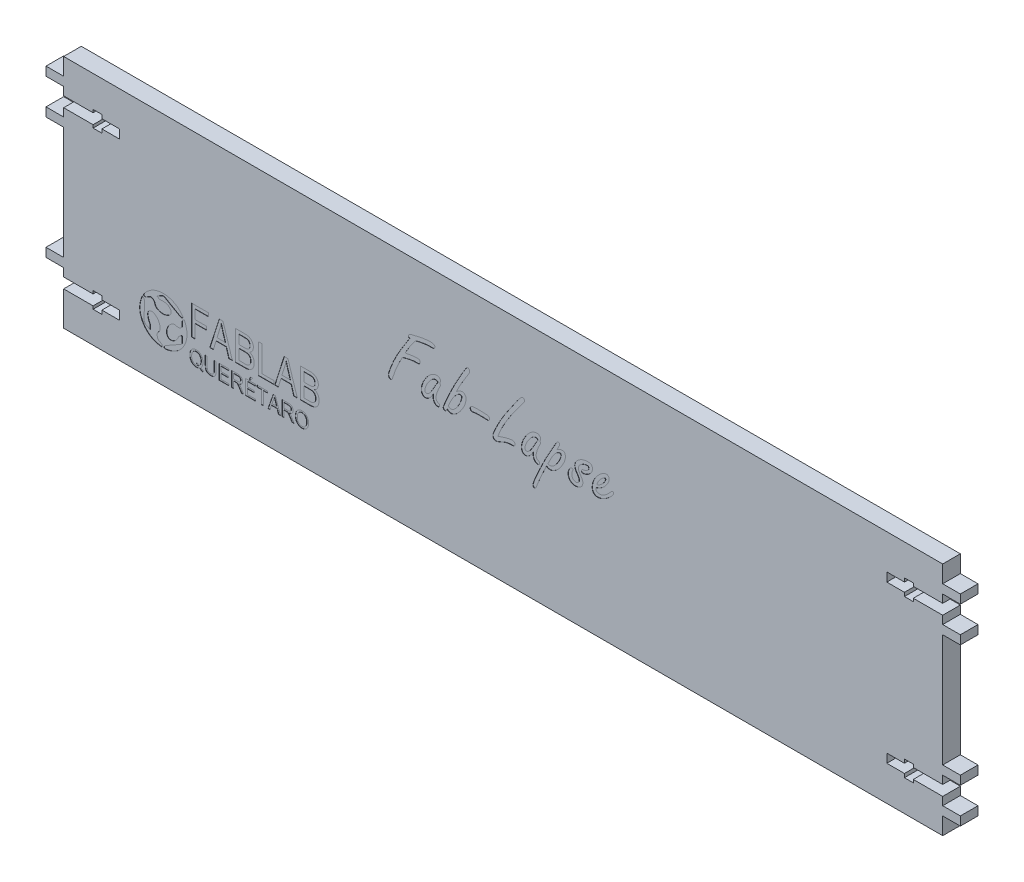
from build123d import *

# Parameters (mm, degrees)
SKETCH1_W           = 298.8
SKETCH1_H           = 80
BOSS_EXTRUDE1_DEPTH = 3
SKETCH2_W           = 6
SKETCH2_H           = 3
BOSS_EXTRUDE3_DEPTH = 6
CUT_EXTRUDE1_DEPTH  = 161.577582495
CUT_EXTRUDE2_DEPTH  = 0.1


with BuildPart() as part:
    # Sketch1 → Boss-Extrude1 (new, symmetric)
    with BuildSketch(Plane.XY):
        Rectangle(SKETCH1_W, SKETCH1_H)
    extrude(amount=BOSS_EXTRUDE1_DEPTH, both=True)

    # Sketch2 → Boss-Extrude3 (add)
    with BuildSketch(Plane.XY.offset(3)):
        with Locations((-152.4, 32.666666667)):
            Rectangle(SKETCH2_W, SKETCH2_H)
        with Locations((-152.4, 20.666666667)):
            Rectangle(SKETCH2_W, SKETCH2_H)
        with Locations((-152.4, -20.666666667)):
            Rectangle(SKETCH2_W, SKETCH2_H)
        with Locations((152.4, 32.666666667)):
            Rectangle(SKETCH2_W, SKETCH2_H)
        with Locations((152.4, 20.666666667)):
            Rectangle(SKETCH2_W, SKETCH2_H)
        with Locations((152.4, -20.666666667)):
            Rectangle(SKETCH2_W, SKETCH2_H)
        with Locations((152.4, -32.666666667)):
            Rectangle(SKETCH2_W, SKETCH2_H)
    extrude(amount=-BOSS_EXTRUDE3_DEPTH)

    # Sketch4 → Cut-Extrude1 (cut, through all)
    with BuildSketch(Plane.XY.offset(3)):
        Polygon((139.4, 24.916666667), (139.4, 23.910766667), (136.4, 23.910766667), (136.4, 25.166666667), (130.4, 25.166666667), (130.4, 28.166666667), (136.4, 28.166666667), (136.4, 29.422566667), (139.4, 29.422566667), (139.4, 28.416666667), (149.4, 28.416666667), (149.4, 24.916666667), align=None)
        Polygon((136.4, -29.422566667), (136.4, -28.166666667), (130.4, -28.166666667), (130.4, -25.166666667), (136.4, -25.166666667), (136.4, -23.910766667), (139.4, -23.910766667), (139.4, -24.916666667), (149.4, -24.916666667), (149.4, -28.416666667), (139.4, -28.416666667), (139.4, -29.422566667), align=None)
        Polygon((-136.4, -29.422566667), (-139.4, -29.422566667), (-139.4, -28.416666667), (-149.4, -28.416666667), (-149.4, -24.916666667), (-139.4, -24.916666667), (-139.4, -23.910766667), (-136.4, -23.910766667), (-136.4, -25.166666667), (-130.4, -25.166666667), (-130.4, -28.166666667), (-136.4, -28.166666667), align=None)
        Polygon((-136.4, 29.422566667), (-136.4, 28.166666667), (-130.4, 28.166666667), (-130.4, 25.166666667), (-136.4, 25.166666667), (-136.4, 23.910766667), (-139.4, 23.910766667), (-139.4, 24.916666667), (-149.4, 24.916666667), (-149.4, 28.416666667), (-139.4, 28.416666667), (-139.4, 29.422566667), align=None)
    extrude(amount=-CUT_EXTRUDE1_DEPTH, mode=Mode.SUBTRACT)

    # Sketch5 → Cut-Extrude2 (cut)
    # profile 1 of 28: a face of its own
    with BuildSketch(Plane.XY.offset(3)):
        with BuildLine():
            add(Edge.make_bspline(
                [(-110.442417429, -23.253020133), (-110.811525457, -24.156210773), (-111.447593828, -24.866197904), (-112.412720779, -25.189049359)],
                knots=[7, 7, 7, 7, 8, 8, 8, 8], degree=3))
            add(Edge.make_bspline(
                [(-112.412720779, -25.189049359), (-113.399977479, -25.519025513), (-114.187985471, -25.043586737), (-114.386316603, -24.023378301)],
                knots=[8, 8, 8, 8, 9, 9, 9, 9], degree=3))
            add(Edge.make_bspline(
                [(-114.386316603, -24.023378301), (-114.670953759, -22.559873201), (-113.52741245, -20.547817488), (-112.098694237, -20.145760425)],
                knots=[9, 9, 9, 9, 10, 10, 10, 10], degree=3))
            add(Edge.make_bspline(
                [(-112.098694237, -20.145760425), (-111.686377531, -20.02979514), (-111.163089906, -20.111891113), (-110.746026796, -20.259620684)],
                knots=[10, 10, 10, 10, 11, 11, 11, 11], degree=3))
            add(Edge.make_bspline(
                [(-110.746026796, -20.259620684), (-110.224464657, -20.443972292), (-109.1283691, -19.909107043), (-109.107399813, -19.348792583)],
                knots=[11, 11, 11, 11, 12, 12, 12, 12], degree=3))
            add(Edge.make_bspline(
                [(-109.107399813, -19.348792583), (-109.092124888, -18.939230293), (-109.071047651, -18.525188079), (-109.11293225, -18.119458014)],
                knots=[12, 12, 12, 12, 13, 13, 13, 13], degree=3))
            add(Edge.make_bspline(
                [(-109.11293225, -18.119458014), (-109.168553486, -17.581678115), (-108.992109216, -17.248571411), (-108.381867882, -17.137598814)],
                knots=[13, 13, 13, 13, 14, 14, 14, 14], degree=3))
            add(Edge.make_bspline(
                [(-108.381867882, -17.137598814), (-107.198250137, -19.570575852), (-107.113914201, -22.032780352), (-108.354448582, -24.457715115)],
                knots=[0, 0, 0, 0, 1, 1, 1, 1], degree=3))
            add(Edge.make_bspline(
                [(-108.354448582, -24.457715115), (-109.755747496, -27.197297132), (-112.076024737, -28.609930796), (-115.143882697, -28.87505599)],
                knots=[1, 1, 1, 1, 2, 2, 2, 2], degree=3))
            add(Edge.make_bspline(
                [(-115.143882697, -28.87505599), (-115.346152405, -28.349555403), (-115.214374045, -28.036986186), (-114.72457792, -27.76551893)],
                knots=[2, 2, 2, 2, 3, 3, 3, 3], degree=3))
            add(Edge.make_bspline(
                [(-114.72457792, -27.76551893), (-113.026929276, -26.824653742), (-111.363122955, -25.821825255), (-109.663099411, -24.885439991)],
                knots=[3, 3, 3, 3, 4, 4, 4, 4], degree=3))
            add(Edge.make_bspline(
                [(-109.663099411, -24.885439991), (-109.215187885, -24.638504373), (-109.057607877, -24.35729463), (-109.095012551, -23.865771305)],
                knots=[4, 4, 4, 4, 5, 5, 5, 5], degree=3))
            add(Edge.make_bspline(
                [(-109.095012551, -23.865771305), (-109.136924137, -23.316791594), (-109.104647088, -22.761766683), (-109.104647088, -22.129503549)],
                knots=[5, 5, 5, 5, 6, 6, 6, 6], degree=3))
            add(Edge.make_bspline(
                [(-109.104647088, -22.129503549), (-109.72992046, -22.399648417), (-110.190730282, -22.636841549), (-110.442417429, -23.253020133)],
                knots=[6, 6, 6, 6, 7, 7, 7, 7], degree=3))
        make_face()
    # profile 2 of 28: a face of its own
    with BuildSketch(Plane.XY.offset(3)):
        with BuildLine():
            add(Edge.make_bspline(
                [(-109.965654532, -16.679159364), (-111.664247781, -15.657631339), (-113.389558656, -14.679334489), (-115.123075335, -13.717661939)],
                knots=[2, 2, 2, 2, 3, 3, 3, 3], degree=3))
            add(Edge.make_bspline(
                [(-115.123075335, -13.717661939), (-115.332066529, -13.601696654), (-115.69575007, -13.596542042), (-115.91423928, -13.698149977)],
                knots=[3, 3, 3, 3, 4, 4, 4, 4], degree=3))
            add(Edge.make_bspline(
                [(-115.91423928, -13.698149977), (-116.491935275, -13.966972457), (-117.029310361, -14.322775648), (-117.644193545, -14.679469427)],
                knots=[4, 4, 4, 4, 5, 5, 5, 5], degree=3))
            add(Edge.make_bspline(
                [(-117.644193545, -14.679469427), (-117.150160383, -15.066362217), (-116.719116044, -15.263370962), (-116.128899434, -15.179169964)],
                knots=[5, 5, 5, 5, 6, 6, 6, 6], degree=3))
            add(Edge.make_bspline(
                [(-116.128899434, -15.179169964), (-115.231780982, -15.051087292), (-114.360219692, -15.209072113), (-113.604488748, -15.753706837)],
                knots=[6, 6, 6, 6, 7, 7, 7, 7], degree=3))
            add(Edge.make_bspline(
                [(-113.604488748, -15.753706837), (-112.624869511, -16.459750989), (-112.628296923, -17.569047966), (-113.597768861, -18.289857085)],
                knots=[7, 7, 7, 7, 8, 8, 8, 8], degree=3))
            add(Edge.make_bspline(
                [(-113.597768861, -18.289857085), (-114.719558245, -19.123851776), (-116.793709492, -19.151271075), (-117.84962239, -18.245165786)],
                knots=[8, 8, 8, 8, 9, 9, 9, 9], degree=3))
            add(Edge.make_bspline(
                [(-117.84962239, -18.245165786), (-118.200405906, -17.944063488), (-118.426534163, -17.412763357), (-118.542499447, -16.945204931)],
                knots=[9, 9, 9, 9, 10, 10, 10, 10], degree=3))
            add(Edge.make_bspline(
                [(-118.542499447, -16.945204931), (-118.674927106, -16.410744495), (-119.580600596, -15.810380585), (-120.070828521, -16.072995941)],
                knots=[10, 10, 10, 10, 11, 11, 11, 11], degree=3))
            add(Edge.make_bspline(
                [(-120.070828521, -16.072995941), (-120.412652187, -16.256160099), (-120.769885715, -16.423266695), (-121.077705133, -16.653982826)],
                knots=[11, 11, 11, 11, 12, 12, 12, 12], degree=3))
            add(Edge.make_bspline(
                [(-121.077705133, -16.653982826), (-121.532714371, -16.995158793), (-121.923709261, -16.999500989), (-122.302154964, -16.562684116)],
                knots=[12, 12, 12, 12, 13, 13, 13, 13], degree=3))
            add(Edge.make_bspline(
                [(-122.302154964, -16.562684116), (-119.384806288, -11.697404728), (-111.944001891, -11.470358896), (-108.761635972, -16.542119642)],
                knots=[0, 0, 0, 0, 1, 1, 1, 1], degree=3))
            add(Edge.make_bspline(
                [(-108.761635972, -16.542119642), (-109.119922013, -16.973946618), (-109.470057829, -16.977239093), (-109.965654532, -16.679159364)],
                knots=[1, 1, 1, 1, 2, 2, 2, 2], degree=3))
        make_face()
    # profile 3 of 28: a face of its own
    with BuildSketch(Plane.XY.offset(3)):
        with BuildLine():
            add(Edge.make_bspline(
                [(-116.697903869, -24.255038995), (-116.761810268, -24.475095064), (-116.867898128, -24.746292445), (-117.041967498, -24.860150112)],
                knots=[10, 10, 10, 10, 11, 11, 11, 11], degree=3))
            add(Edge.make_bspline(
                [(-117.041967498, -24.860150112), (-117.901411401, -25.423084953), (-117.57302751, -26.281206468), (-117.470502, -26.970386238)],
                knots=[11, 11, 11, 11, 12, 12, 12, 12], degree=3))
            add(Edge.make_bspline(
                [(-117.470502, -26.970386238), (-117.42122128, -27.302197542), (-116.760622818, -27.577604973), (-116.338943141, -27.809535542)],
                knots=[12, 12, 12, 12, 13, 13, 13, 13], degree=3))
            add(Edge.make_bspline(
                [(-116.338943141, -27.809535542), (-115.938232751, -28.029861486), (-115.748861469, -28.278386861), (-115.9705098, -28.814442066)],
                knots=[13, 13, 13, 13, 14, 14, 14, 14], degree=3))
            add(Edge.make_bspline(
                [(-115.9705098, -28.814442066), (-118.765713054, -28.602293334), (-120.945007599, -27.367828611), (-122.383198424, -24.987695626)],
                knots=[0, 0, 0, 0, 1, 1, 1, 1], degree=3))
            add(Edge.make_bspline(
                [(-122.383198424, -24.987695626), (-123.904942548, -22.469222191), (-123.896117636, -19.845062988), (-122.685350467, -17.180293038)],
                knots=[1, 1, 1, 1, 2, 2, 2, 2], degree=3))
            add(Edge.make_bspline(
                [(-122.685350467, -17.180293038), (-122.128490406, -17.277555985), (-121.981408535, -17.573392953), (-121.989207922, -18.087693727)],
                knots=[2, 2, 2, 2, 3, 3, 3, 3], degree=3))
            add(Edge.make_bspline(
                [(-121.989207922, -18.087693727), (-122.018057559, -20.008067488), (-121.980489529, -21.929202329), (-122.013712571, -23.849443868)],
                knots=[3, 3, 3, 3, 4, 4, 4, 4], degree=3))
            add(Edge.make_bspline(
                [(-122.013712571, -23.849443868), (-122.023320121, -24.398933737), (-121.865983, -24.73047777), (-121.356268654, -24.95107359)],
                knots=[4, 4, 4, 4, 5, 5, 5, 5], degree=3))
            add(Edge.make_bspline(
                [(-121.356268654, -24.95107359), (-120.910625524, -25.14425011), (-120.501063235, -25.420710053), (-119.969490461, -25.720379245)],
                knots=[5, 5, 5, 5, 6, 6, 6, 6], degree=3))
            add(Edge.make_bspline(
                [(-119.969490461, -25.720379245), (-119.985303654, -24.955553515), (-119.888042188, -24.356511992), (-120.241983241, -23.698934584)],
                knots=[6, 6, 6, 6, 7, 7, 7, 7], degree=3))
            add(Edge.make_bspline(
                [(-120.241983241, -23.698934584), (-120.594089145, -23.045081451), (-120.827477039, -22.243876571), (-120.831956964, -21.505417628)],
                knots=[7, 7, 7, 7, 8, 8, 8, 8], degree=3))
            add(Edge.make_bspline(
                [(-120.831956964, -21.505417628), (-120.839324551, -20.33618422), (-119.891739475, -19.807094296), (-118.789704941, -20.210989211)],
                knots=[8, 8, 8, 8, 9, 9, 9, 9], degree=3))
            add(Edge.make_bspline(
                [(-118.789704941, -20.210989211), (-117.358503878, -20.73559921), (-116.277411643, -22.808670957), (-116.697903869, -24.255038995)],
                knots=[9, 9, 9, 9, 10, 10, 10, 10], degree=3))
        make_face()
    # profile 4 of 28: a face of its own
    with BuildSketch(Plane.XY.offset(3)):
        with BuildLine():
            Line((31.510796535, 3.517951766), (31.510796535, 3.274522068))
            add(Edge.make_bspline(
                [(31.510796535, 3.274522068), (31.515347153, 3.179510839), (31.524107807, 2.996599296), (31.613237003, 2.836916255), (31.656069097, 2.760178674)],
                knots=[0, 0, 0, 0, 1.038876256, 2, 2, 2, 2], degree=3))
            add(Edge.make_bspline(
                [(31.656069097, 2.760178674), (31.715923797, 2.682334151), (31.834696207, 2.527863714), (32.095328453, 2.372846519), (32.400423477, 2.276265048), (32.622396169, 2.266632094), (32.739723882, 2.261540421)],
                knots=[0, 0, 0, 0, 0.939783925, 1.864856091, 2.871430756, 4, 4, 4, 4], degree=3))
            add(Edge.make_bspline(
                [(32.739723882, 2.261540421), (32.881961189, 2.269079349), (33.175334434, 2.284628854), (33.616567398, 2.419758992), (34.075821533, 2.615575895), (34.546727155, 2.901064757), (35.035960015, 3.260480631), (35.535012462, 3.705722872), (36.06109462, 4.218122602), (36.396603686, 4.604197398), (36.571778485, 4.805773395)],
                knots=[0, 0, 0, 0, 0.720683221, 1.486453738, 2.325776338, 3.252235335, 4.274225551, 5.404349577, 6.644768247, 8, 8, 8, 8], degree=3))
            add(Edge.make_bspline(
                [(36.571778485, 4.805773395), (36.63174867, 4.871567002), (36.740689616, 4.991086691), (36.910385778, 5.131873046), (37.0673766, 5.224032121), (37.172998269, 5.238938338), (37.219615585, 5.245517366)],
                knots=[0, 0, 0, 0, 1.329936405, 2.415942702, 3.30085843, 4, 4, 4, 4], degree=3))
            add(Edge.make_bspline(
                [(37.219615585, 5.245517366), (37.269193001, 5.238445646), (37.375579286, 5.223270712), (37.44795521, 5.143070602), (37.486602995, 5.100244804)],
                knots=[0, 0, 0, 0, 0.932026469, 2, 2, 2, 2], degree=3))
            add(Edge.make_bspline(
                [(37.486602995, 5.100244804), (37.509459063, 5.067432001), (37.55172827, 5.006749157), (37.560911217, 4.933599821), (37.565128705, 4.900004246)],
                knots=[0, 0, 0, 0, 1.081452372, 2, 2, 2, 2], degree=3))
            add(Edge.make_bspline(
                [(37.565128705, 4.900004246), (37.560612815, 4.852452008), (37.550672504, 4.747780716), (37.484791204, 4.583447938), (37.379700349, 4.401142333), (37.241904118, 4.190523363), (37.059857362, 3.962573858), (36.842427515, 3.708636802), (36.583598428, 3.43551319), (36.393178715, 3.250257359), (36.293012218, 3.152807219)],
                knots=[0, 0, 0, 0, 0.519768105, 1.144105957, 1.912229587, 2.820522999, 3.890404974, 5.097186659, 6.473032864, 8, 8, 8, 8], degree=3))
            add(Edge.make_bspline(
                [(36.293012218, 3.152807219), (36.125929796, 2.997719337), (35.796429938, 2.691873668), (35.277002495, 2.271831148), (34.735387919, 1.906755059), (34.35889109, 1.697493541), (34.172818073, 1.594071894)],
                knots=[0, 0, 0, 0, 1.035913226, 2.042903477, 3.032759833, 4, 4, 4, 4], degree=3))
            add(Edge.make_bspline(
                [(34.172818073, 1.594071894), (33.990279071, 1.502837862), (33.63940434, 1.327468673), (33.100378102, 1.151823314), (32.585982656, 1.024463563), (32.245728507, 1.01145908), (32.080107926, 1.005129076)],
                knots=[0, 0, 0, 0, 1.114469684, 2.14222302, 3.095716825, 4, 4, 4, 4], degree=3))
            add(Edge.make_bspline(
                [(32.080107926, 1.005129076), (31.928264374, 1.011852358), (31.637593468, 1.024722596), (31.231436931, 1.167803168), (30.872849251, 1.387118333), (30.69421142, 1.600146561), (30.603824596, 1.707934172)],
                knots=[0, 0, 0, 0, 1.06896785, 2.046302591, 3.011471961, 4, 4, 4, 4], degree=3))
            add(Edge.make_bspline(
                [(30.603824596, 1.707934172), (30.549335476, 1.795199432), (30.436586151, 1.975769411), (30.329533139, 2.292855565), (30.268182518, 2.650424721), (30.259137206, 2.90255847), (30.25438519, 3.035018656)],
                knots=[0, 0, 0, 0, 0.883779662, 1.828723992, 2.859305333, 4, 4, 4, 4], degree=3))
            add(Edge.make_bspline(
                [(30.25438519, 3.035018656), (30.260536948, 3.225158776), (30.272914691, 3.607733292), (30.370682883, 4.177956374), (30.529757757, 4.744536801), (30.750808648, 5.307471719), (31.037026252, 5.867396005), (31.382686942, 6.42488916), (31.794239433, 6.977695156), (32.10495849, 7.329952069), (32.264643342, 7.510984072)],
                knots=[0, 0, 0, 0, 0.908113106, 1.827183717, 2.755736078, 3.716086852, 4.711684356, 5.756347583, 6.846941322, 8, 8, 8, 8], degree=3))
            add(Edge.make_bspline(
                [(32.264643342, 7.510984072), (32.39635081, 7.652776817), (32.648468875, 7.924200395), (33.039010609, 8.286538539), (33.415269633, 8.593733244), (33.777203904, 8.848588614), (34.127805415, 9.047573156), (34.465519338, 9.1913291), (34.792569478, 9.280079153), (35.007320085, 9.291782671), (35.111200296, 9.297443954)],
                knots=[0, 0, 0, 0, 1.346932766, 2.578335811, 3.70536743, 4.726507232, 5.656640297, 6.506114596, 7.277370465, 8, 8, 8, 8], degree=3))
            add(Edge.make_bspline(
                [(35.111200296, 9.297443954), (35.165223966, 9.295937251), (35.272498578, 9.292945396), (35.42567836, 9.245914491), (35.573592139, 9.179055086), (35.659471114, 9.112259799), (35.7040694, 9.077571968)],
                knots=[0, 0, 0, 0, 0.999899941, 1.985497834, 2.953837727, 4, 4, 4, 4], degree=3))
            add(Edge.make_bspline(
                [(35.7040694, 9.077571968), (35.755336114, 9.028822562), (35.856164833, 8.932944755), (35.958305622, 8.748548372), (36.025018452, 8.544282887), (36.030858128, 8.398894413), (36.033877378, 8.323725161)],
                knots=[0, 0, 0, 0, 0.993693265, 1.954344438, 2.942348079, 4, 4, 4, 4], degree=3))
            add(Edge.make_bspline(
                [(36.033877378, 8.323725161), (36.02533266, 8.19472051), (36.007065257, 7.918926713), (35.877487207, 7.491755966), (35.679074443, 7.025145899), (35.500828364, 6.71218957), (35.405671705, 6.545117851)],
                knots=[0, 0, 0, 0, 0.811569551, 1.735021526, 2.790841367, 4, 4, 4, 4], degree=3))
            add(Edge.make_bspline(
                [(35.405671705, 6.545117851), (35.293905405, 6.367364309), (35.072495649, 6.015233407), (34.682295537, 5.531587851), (34.258519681, 5.084099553), (33.788615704, 4.683653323), (33.279464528, 4.323453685), (32.727533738, 4.010286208), (32.136263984, 3.737146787), (31.721519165, 3.591799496), (31.510796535, 3.517951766)],
                knots=[0, 0, 0, 0, 0.997761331, 1.976571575, 2.949427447, 3.92490772, 4.90745069, 5.911018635, 6.938634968, 8, 8, 8, 8], degree=3))
        make_face()
        with BuildLine():
            add(Edge.make_bspline(
                [(31.762078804, 4.523080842), (31.904320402, 4.577269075), (32.176819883, 4.681080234), (32.552539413, 4.862481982), (32.884088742, 5.048259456), (33.076110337, 5.192453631), (33.167688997, 5.261222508)],
                knots=[0, 0, 0, 0, 1.145286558, 2.194083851, 3.138725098, 4, 4, 4, 4], degree=3))
            add(Edge.make_bspline(
                [(33.167688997, 5.261222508), (33.311553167, 5.385533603), (33.594956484, 5.630418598), (33.972565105, 6.040002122), (34.309481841, 6.468330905), (34.493959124, 6.777289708), (34.585078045, 6.929893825)],
                knots=[0, 0, 0, 0, 1.035673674, 2.04021163, 3.032001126, 4, 4, 4, 4], degree=3))
            add(Edge.make_bspline(
                [(34.585078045, 6.929893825), (34.64153184, 7.030767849), (34.743946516, 7.213766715), (34.767083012, 7.421627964), (34.777466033, 7.514910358)],
                knots=[0, 0, 0, 0, 1.102455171, 2, 2, 2, 2], degree=3))
            add(Edge.make_bspline(
                [(34.777466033, 7.514910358), (34.774948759, 7.555825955), (34.770450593, 7.62893884), (34.726878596, 7.72857407), (34.63754767, 7.783831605), (34.570053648, 7.787690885), (34.534036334, 7.78975034)],
                knots=[0, 0, 0, 0, 1.168462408, 2.08794847, 2.979658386, 4, 4, 4, 4], degree=3))
            add(Edge.make_bspline(
                [(34.534036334, 7.78975034), (34.47149728, 7.782758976), (34.32915671, 7.766846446), (34.112651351, 7.64696635), (33.854898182, 7.484327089), (33.682775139, 7.33704335), (33.58780154, 7.255775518)],
                knots=[0, 0, 0, 0, 0.678255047, 1.543726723, 2.644684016, 4, 4, 4, 4], degree=3))
            add(Edge.make_bspline(
                [(33.58780154, 7.255775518), (33.495905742, 7.174955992), (33.310058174, 7.011508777), (33.056164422, 6.731428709), (32.807046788, 6.431598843), (32.577909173, 6.098445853), (32.352174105, 5.745297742), (32.14002989, 5.364283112), (31.944462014, 4.953643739), (31.823815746, 4.668826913), (31.762078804, 4.523080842)],
                knots=[0, 0, 0, 0, 0.884611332, 1.789013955, 2.730944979, 3.702805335, 4.711417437, 5.762504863, 6.855032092, 8, 8, 8, 8], degree=3))
        make_face(mode=Mode.SUBTRACT)
    # profile 5 of 28: a face of its own
    with BuildSketch(Plane.XY.offset(3)):
        with BuildLine():
            add(Edge.make_bspline(
                [(28.717637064, 9.800008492), (28.84619592, 9.796870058), (29.087835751, 9.790971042), (29.423190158, 9.731916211), (29.71171954, 9.640548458), (29.946538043, 9.50113696), (30.137827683, 9.325418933), (30.263035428, 9.099175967), (30.34619301, 8.837303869), (30.3518881, 8.647722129), (30.354898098, 8.547523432)],
                knots=[0, 0, 0, 0, 1.30941663, 2.461185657, 3.461276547, 4.376681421, 5.226100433, 6.075204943, 6.982697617, 8, 8, 8, 8], degree=3))
            add(Edge.make_bspline(
                [(30.354898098, 8.547523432), (30.348226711, 8.409370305), (30.334875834, 8.132896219), (30.220520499, 7.723219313), (30.041309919, 7.320371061), (29.869702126, 7.072676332), (29.781660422, 6.945598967)],
                knots=[0, 0, 0, 0, 0.956575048, 1.914312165, 2.929958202, 4, 4, 4, 4], degree=3))
            add(Edge.make_bspline(
                [(29.781660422, 6.945598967), (29.681587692, 6.82717459), (29.475767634, 6.58361061), (29.092317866, 6.270783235), (28.642609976, 5.992843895), (28.310024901, 5.844887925), (28.136546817, 5.767713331)],
                knots=[0, 0, 0, 0, 0.907796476, 1.867069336, 2.887452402, 4, 4, 4, 4], degree=3))
            add(Edge.make_bspline(
                [(28.136546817, 5.767713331), (28.041552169, 5.730793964), (27.861560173, 5.660840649), (27.597581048, 5.585698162), (27.358093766, 5.539992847), (27.206177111, 5.531956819), (27.135344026, 5.528209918)],
                knots=[0, 0, 0, 0, 1.181048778, 2.237803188, 3.178353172, 4, 4, 4, 4], degree=3))
            add(Edge.make_bspline(
                [(27.135344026, 5.528209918), (27.054332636, 5.532489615), (26.907324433, 5.540255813), (26.715104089, 5.638112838), (26.600186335, 5.813378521), (26.590775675, 5.949165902), (26.585664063, 6.022921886)],
                knots=[0, 0, 0, 0, 1.148630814, 2.084375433, 2.959485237, 4, 4, 4, 4], degree=3))
            add(Edge.make_bspline(
                [(26.585664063, 6.022921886), (26.588974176, 6.075960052), (26.595519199, 6.180831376), (26.661355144, 6.32413882), (26.766518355, 6.446393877), (26.85851659, 6.503082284), (26.90761947, 6.533338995)],
                knots=[0, 0, 0, 0, 0.996421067, 1.970203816, 2.916622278, 4, 4, 4, 4], degree=3))
            add(Edge.make_bspline(
                [(26.90761947, 6.533338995), (26.936292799, 6.544176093), (27.024696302, 6.577588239), (27.208137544, 6.623436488), (27.484859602, 6.689876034), (27.699434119, 6.742610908), (27.82244398, 6.772842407)],
                knots=[0, 0, 0, 0, 0.388567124, 1.198001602, 2.393688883, 4, 4, 4, 4], degree=3))
            add(Edge.make_bspline(
                [(27.82244398, 6.772842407), (27.904412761, 6.79540504), (28.068399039, 6.840543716), (28.301912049, 6.950880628), (28.529352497, 7.087740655), (28.66678012, 7.203998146), (28.737268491, 7.263628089)],
                knots=[0, 0, 0, 0, 0.971283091, 1.943143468, 2.94501219, 4, 4, 4, 4], degree=3))
            add(Edge.make_bspline(
                [(28.737268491, 7.263628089), (28.791717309, 7.316761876), (28.895636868, 7.4181716), (29.012505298, 7.59343166), (29.083372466, 7.77804831), (29.093506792, 7.904362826), (29.098486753, 7.966433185)],
                knots=[0, 0, 0, 0, 1.120126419, 2.137843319, 3.084944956, 4, 4, 4, 4], degree=3))
            add(Edge.make_bspline(
                [(29.098486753, 7.966433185), (29.093875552, 8.053815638), (29.085335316, 8.215653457), (28.943501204, 8.420092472), (28.713601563, 8.530692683), (28.539630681, 8.5389828), (28.442797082, 8.543597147)],
                knots=[0, 0, 0, 0, 1.035889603, 1.918532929, 2.841438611, 4, 4, 4, 4], degree=3))
            add(Edge.make_bspline(
                [(28.442797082, 8.543597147), (28.305967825, 8.535209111), (28.021423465, 8.517765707), (27.587845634, 8.394236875), (27.135300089, 8.201689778), (26.841437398, 8.024018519), (26.687747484, 7.931096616)],
                knots=[0, 0, 0, 0, 0.871873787, 1.813112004, 2.856259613, 4, 4, 4, 4], degree=3))
            add(Edge.make_bspline(
                [(26.687747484, 7.931096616), (26.600097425, 7.873928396), (26.431384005, 7.763888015), (26.20714153, 7.576422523), (26.010304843, 7.38675539), (25.859111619, 7.17917336), (25.731553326, 6.969936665), (25.648278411, 6.748459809), (25.586804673, 6.520943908), (25.582641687, 6.364933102), (25.580534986, 6.285983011)],
                knots=[0, 0, 0, 0, 1.209290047, 2.32770476, 3.376757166, 4.360767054, 5.290282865, 6.201119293, 7.089666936, 8, 8, 8, 8], degree=3))
            add(Edge.make_bspline(
                [(25.580534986, 6.285983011), (25.589439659, 6.164422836), (25.608708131, 5.901383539), (25.766193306, 5.498190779), (25.98229502, 5.046608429), (26.185766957, 4.749501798), (26.295118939, 4.589827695)],
                knots=[0, 0, 0, 0, 0.780136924, 1.688107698, 2.757519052, 4, 4, 4, 4], degree=3))
            add(Edge.make_bspline(
                [(26.295118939, 4.589827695), (26.413856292, 4.414021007), (26.635530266, 4.085802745), (26.893568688, 3.594500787), (27.05027717, 3.138564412), (27.076232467, 2.844875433), (27.088228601, 2.709136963)],
                knots=[0, 0, 0, 0, 1.229410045, 2.295218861, 3.212076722, 4, 4, 4, 4], degree=3))
            add(Edge.make_bspline(
                [(27.088228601, 2.709136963), (27.085644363, 2.615952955), (27.080544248, 2.432049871), (27.027400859, 2.165636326), (26.945860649, 1.91348011), (26.8243477, 1.680251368), (26.67664776, 1.459191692), (26.49070912, 1.256978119), (26.275944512, 1.066118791), (26.109633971, 0.960979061), (26.024205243, 0.90697194)],
                knots=[0, 0, 0, 0, 1.016981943, 2.007062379, 2.956761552, 3.90333298, 4.871163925, 5.853363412, 6.897337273, 8, 8, 8, 8], degree=3))
            add(Edge.make_bspline(
                [(26.024205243, 0.90697194), (25.913361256, 0.844328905), (25.691279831, 0.718820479), (25.323800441, 0.597123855), (24.937838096, 0.513207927), (24.671420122, 0.506148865), (24.536143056, 0.502564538)],
                knots=[0, 0, 0, 0, 0.976322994, 1.95611153, 2.962190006, 4, 4, 4, 4], degree=3))
            add(Edge.make_bspline(
                [(24.536143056, 0.502564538), (24.429972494, 0.505673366), (24.223269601, 0.511725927), (23.923353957, 0.555980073), (23.642039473, 0.625274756), (23.380225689, 0.727662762), (23.141045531, 0.86326448), (22.917291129, 1.020750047), (22.714525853, 1.210762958), (22.599888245, 1.358144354), (22.541590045, 1.433094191)],
                knots=[0, 0, 0, 0, 1.11240044, 2.165726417, 3.170416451, 4.143426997, 5.101334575, 6.045293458, 7.005946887, 8, 8, 8, 8], degree=3))
            add(Edge.make_bspline(
                [(22.541590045, 1.433094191), (22.468008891, 1.544696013), (22.320524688, 1.768387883), (22.174365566, 2.147822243), (22.080117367, 2.552697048), (22.068513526, 2.83291503), (22.06258322, 2.976124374)],
                knots=[0, 0, 0, 0, 0.974751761, 1.953767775, 2.954244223, 4, 4, 4, 4], degree=3))
            add(Edge.make_bspline(
                [(22.06258322, 2.976124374), (22.068406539, 3.143076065), (22.079687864, 3.466506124), (22.194429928, 3.928068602), (22.373451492, 4.351223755), (22.551004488, 4.59408463), (22.639747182, 4.71546883)],
                knots=[0, 0, 0, 0, 1.070283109, 2.073424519, 3.037079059, 4, 4, 4, 4], degree=3))
            add(Edge.make_bspline(
                [(22.639747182, 4.71546883), (22.700121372, 4.786050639), (22.812878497, 4.9178719), (23.008419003, 5.066815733), (23.208795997, 5.162132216), (23.346894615, 5.173371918), (23.413225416, 5.178770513)],
                knots=[0, 0, 0, 0, 1.192968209, 2.228032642, 3.148897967, 4, 4, 4, 4], degree=3))
            add(Edge.make_bspline(
                [(23.413225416, 5.178770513), (23.462352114, 5.177254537), (23.549851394, 5.17455444), (23.662852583, 5.121287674), (23.736417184, 5.028346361), (23.740726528, 4.95242507), (23.743033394, 4.911783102)],
                knots=[0, 0, 0, 0, 1.209289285, 2.15385825, 3.011728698, 4, 4, 4, 4], degree=3))
            add(Edge.make_bspline(
                [(23.743033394, 4.911783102), (23.736027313, 4.866549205), (23.718460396, 4.753130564), (23.660243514, 4.653593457), (23.625244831, 4.593753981)],
                knots=[0, 0, 0, 0, 0.797644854, 2, 2, 2, 2], degree=3))
            add(Edge.make_bspline(
                [(23.625244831, 4.593753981), (23.577714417, 4.495466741), (23.481408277, 4.296317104), (23.3912544, 3.969585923), (23.328774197, 3.621133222), (23.322322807, 3.37953173), (23.318994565, 3.254890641)],
                knots=[0, 0, 0, 0, 0.943174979, 1.911061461, 2.922326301, 4, 4, 4, 4], degree=3))
            add(Edge.make_bspline(
                [(23.318994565, 3.254890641), (23.325381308, 3.150884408), (23.337900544, 2.94701233), (23.426977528, 2.652829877), (23.57896056, 2.383259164), (23.721233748, 2.232643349), (23.794075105, 2.155530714)],
                knots=[0, 0, 0, 0, 1.01318953, 1.986044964, 2.968890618, 4, 4, 4, 4], degree=3))
            add(Edge.make_bspline(
                [(23.794075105, 2.155530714), (23.865469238, 2.095310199), (24.004148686, 1.978334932), (24.241581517, 1.849128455), (24.495969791, 1.771609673), (24.671729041, 1.763197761), (24.759941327, 1.758975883)],
                knots=[0, 0, 0, 0, 1.045915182, 2.031636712, 3.012092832, 4, 4, 4, 4], degree=3))
            add(Edge.make_bspline(
                [(24.759941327, 1.758975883), (24.844339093, 1.761453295), (25.005678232, 1.766189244), (25.230403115, 1.837989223), (25.431047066, 1.942948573), (25.535726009, 2.047809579), (25.588387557, 2.100562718)],
                knots=[0, 0, 0, 0, 1.09126884, 2.086126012, 3.037174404, 4, 4, 4, 4], degree=3))
            add(Edge.make_bspline(
                [(25.588387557, 2.100562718), (25.625462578, 2.151805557), (25.699668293, 2.254368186), (25.781238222, 2.431658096), (25.822226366, 2.63136183), (25.828542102, 2.770485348), (25.831817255, 2.842630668)],
                knots=[0, 0, 0, 0, 0.951244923, 1.903918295, 2.913034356, 4, 4, 4, 4], degree=3))
            add(Edge.make_bspline(
                [(25.831817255, 2.842630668), (25.822922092, 2.942975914), (25.803457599, 3.162552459), (25.67170555, 3.504703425), (25.469733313, 3.88539168), (25.291775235, 4.141480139), (25.195759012, 4.279651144)],
                knots=[0, 0, 0, 0, 0.755704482, 1.653640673, 2.734035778, 4, 4, 4, 4], degree=3))
            add(Edge.make_bspline(
                [(25.195759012, 4.279651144), (25.063057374, 4.473977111), (24.811622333, 4.842174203), (24.542818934, 5.414863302), (24.358945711, 5.956768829), (24.33539799, 6.314801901), (24.324123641, 6.486223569)],
                knots=[0, 0, 0, 0, 1.170833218, 2.218423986, 3.147004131, 4, 4, 4, 4], degree=3))
            add(Edge.make_bspline(
                [(24.324123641, 6.486223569), (24.32876249, 6.595228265), (24.337960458, 6.811364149), (24.408720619, 7.129367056), (24.517561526, 7.440493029), (24.682448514, 7.73694494), (24.884371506, 8.028189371), (25.133791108, 8.305703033), (25.426790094, 8.575605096), (25.646915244, 8.73806078), (25.761144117, 8.822363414)],
                knots=[0, 0, 0, 0, 0.915590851, 1.815445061, 2.72725999, 3.677369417, 4.657148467, 5.701517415, 6.807255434, 8, 8, 8, 8], degree=3))
            add(Edge.make_bspline(
                [(25.761144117, 8.822363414), (25.8779987, 8.899770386), (26.108703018, 9.052593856), (26.466408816, 9.252890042), (26.82931965, 9.42377216), (27.197531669, 9.559872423), (27.569849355, 9.668475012), (27.948556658, 9.741186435), (28.331541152, 9.791079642), (28.589222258, 9.797038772), (28.717637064, 9.800008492)],
                knots=[0, 0, 0, 0, 1.063098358, 2.098859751, 3.107178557, 4.103101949, 5.074165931, 6.045838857, 7.026148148, 8, 8, 8, 8], degree=3))
        make_face()
    # profile 6 of 28: a face of its own
    with BuildSketch(Plane.XY.offset(3)):
        with BuildLine():
            add(Edge.make_bspline(
                [(18.299631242, 8.139189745), (18.379331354, 8.186528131), (18.527559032, 8.274568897), (18.733572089, 8.392605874), (18.908782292, 8.483530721), (19.014153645, 8.535869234), (19.061330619, 8.559302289)],
                knots=[0, 0, 0, 0, 1.278359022, 2.377514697, 3.273579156, 4, 4, 4, 4], degree=3))
            add(Edge.make_bspline(
                [(19.061330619, 8.559302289), (19.227896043, 8.627978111), (19.547949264, 8.75993778), (19.893088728, 8.783553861), (20.058607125, 8.794879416)],
                knots=[0, 0, 0, 0, 1.040860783, 2, 2, 2, 2], degree=3))
            add(Edge.make_bspline(
                [(20.058607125, 8.794879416), (20.145427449, 8.791929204), (20.309904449, 8.786340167), (20.539770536, 8.722611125), (20.735480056, 8.615028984), (20.891493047, 8.459318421), (21.016467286, 8.2659363), (21.100980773, 8.028417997), (21.15146149, 7.750022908), (21.155706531, 7.55049012), (21.157967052, 7.44423722)],
                knots=[0, 0, 0, 0, 1.043744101, 1.977323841, 2.845771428, 3.70442851, 4.605478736, 5.598432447, 6.721144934, 8, 8, 8, 8], degree=3))
            add(Edge.make_bspline(
                [(21.157967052, 7.44423722), (21.149728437, 7.282610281), (21.132177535, 6.938292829), (20.99914735, 6.404259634), (20.798199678, 5.823393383), (20.614824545, 5.432382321), (20.517982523, 5.225885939)],
                knots=[0, 0, 0, 0, 0.83294812, 1.774447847, 2.824666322, 4, 4, 4, 4], degree=3))
            add(Edge.make_bspline(
                [(20.517982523, 5.225885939), (20.434383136, 5.058898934), (20.269961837, 4.730472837), (20.001273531, 4.257531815), (19.720754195, 3.81121438), (19.424696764, 3.394046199), (19.119104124, 3.002701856), (18.794697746, 2.642610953), (18.464630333, 2.302584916), (18.227889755, 2.098901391), (18.11116954, 1.998479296)],
                knots=[0, 0, 0, 0, 1.10481091, 2.172916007, 3.217059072, 4.222611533, 5.198626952, 6.152989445, 7.089368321, 8, 8, 8, 8], degree=3))
            add(Edge.make_bspline(
                [(18.11116954, 1.998479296), (18.013913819, 1.920105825), (17.823644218, 1.766777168), (17.531978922, 1.563171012), (17.242604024, 1.39517834), (16.963943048, 1.248338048), (16.682992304, 1.144518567), (16.40924207, 1.064551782), (16.139371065, 1.014536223), (15.961071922, 1.008235), (15.873186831, 1.005129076)],
                knots=[0, 0, 0, 0, 1.200415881, 2.348475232, 3.414260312, 4.415665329, 5.371220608, 6.287031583, 7.155664, 8, 8, 8, 8], degree=3))
            add(Edge.make_bspline(
                [(15.873186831, 1.005129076), (15.777145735, 1.010890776), (15.581978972, 1.022599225), (15.292066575, 1.105182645), (15.004397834, 1.240900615), (14.826967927, 1.367278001), (14.73456405, 1.433094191)],
                knots=[0, 0, 0, 0, 0.930697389, 1.891286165, 2.901801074, 4, 4, 4, 4], degree=3))
            add(Edge.make_bspline(
                [(14.73456405, 1.433094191), (14.424725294, 0.815782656), (13.805693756, -0.417553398), (12.942089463, -2.297627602), (12.116640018, -4.192159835), (11.610789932, -5.473029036), (11.35795856, -6.113226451)],
                knots=[0, 0, 0, 0, 1.002071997, 2.002054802, 3.001397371, 4, 4, 4, 4], degree=3))
            add(Edge.make_bspline(
                [(11.35795856, -6.113226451), (11.310349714, -6.250502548), (11.226015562, -6.49367297), (11.05462366, -6.785884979), (10.867839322, -6.992559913), (10.713277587, -7.022405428), (10.643374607, -7.035903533)],
                knots=[0, 0, 0, 0, 1.410846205, 2.499168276, 3.321225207, 4, 4, 4, 4], degree=3))
            add(Edge.make_bspline(
                [(10.643374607, -7.035903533), (10.609974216, -7.032935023), (10.539400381, -7.026662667), (10.439562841, -6.967148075), (10.335464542, -6.885878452), (10.277859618, -6.809871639), (10.246819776, -6.768916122)],
                knots=[0, 0, 0, 0, 0.803944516, 1.698706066, 2.759970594, 4, 4, 4, 4], degree=3))
            add(Edge.make_bspline(
                [(10.246819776, -6.768916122), (10.203956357, -6.704314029), (10.120033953, -6.577829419), (10.107620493, -6.426679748), (10.101547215, -6.352729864)],
                knots=[0, 0, 0, 0, 1.021501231, 2, 2, 2, 2], degree=3))
            add(Edge.make_bspline(
                [(10.101547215, -6.352729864), (10.103700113, -6.318656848), (10.108608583, -6.240972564), (10.128944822, -6.112169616), (10.164978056, -5.958869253), (10.218282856, -5.781789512), (10.279850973, -5.576777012), (10.359624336, -5.347228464), (10.448586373, -5.091033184), (10.557017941, -4.812316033), (10.673838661, -4.505194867), (10.805776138, -4.173373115), (10.959002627, -3.818299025), (11.116577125, -3.434146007), (11.294963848, -3.027085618), (11.483274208, -2.593250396), (11.686772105, -2.134860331), (11.830107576, -1.821654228), (11.903712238, -1.660818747)],
                knots=[0, 0, 0, 0, 0.325073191, 0.74114596, 1.240097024, 1.824005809, 2.502228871, 3.278830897, 4.13835149, 5.085274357, 6.127061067, 7.268294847, 8.486139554, 9.810412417, 11.223034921, 12.719161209, 14.315245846, 16, 16, 16, 16], degree=3))
            add(Edge.make_bspline(
                [(11.903712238, -1.660818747), (12.134309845, -1.160382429), (12.586379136, -0.179314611), (13.268920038, 1.25487292), (13.94580123, 2.621251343), (14.60821366, 3.926158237), (15.262854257, 5.166341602), (15.910288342, 6.34079095), (16.550202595, 7.448898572), (16.981808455, 8.160850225), (17.192418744, 8.508260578)],
                knots=[0, 0, 0, 0, 1.153012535, 2.26039448, 3.323500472, 4.343754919, 5.322589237, 6.257854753, 7.149887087, 8, 8, 8, 8], degree=3))
            add(Edge.make_bspline(
                [(17.192418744, 8.508260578), (17.272149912, 8.64050663), (17.417357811, 8.881355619), (17.616350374, 9.208267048), (17.767888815, 9.469670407), (17.85471759, 9.621979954), (17.891297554, 9.686146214)],
                knots=[0, 0, 0, 0, 1.352926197, 2.463974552, 3.352890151, 4, 4, 4, 4], degree=3))
            add(Edge.make_bspline(
                [(17.891297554, 9.686146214), (17.959952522, 9.815364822), (18.082176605, 10.045408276), (18.287966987, 10.324249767), (18.499269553, 10.511494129), (18.657218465, 10.540798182), (18.727596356, 10.553855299)],
                knots=[0, 0, 0, 0, 1.396585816, 2.486293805, 3.325532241, 4, 4, 4, 4], degree=3))
            add(Edge.make_bspline(
                [(18.727596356, 10.553855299), (18.791017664, 10.548220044), (18.909307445, 10.537709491), (19.060932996, 10.422671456), (19.135254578, 10.233426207), (19.143261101, 10.091095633), (19.147708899, 10.012027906)],
                knots=[0, 0, 0, 0, 0.966777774, 1.803178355, 2.779617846, 4, 4, 4, 4], degree=3))
            add(Edge.make_bspline(
                [(19.147708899, 10.012027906), (19.14272966, 9.956809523), (19.13189619, 9.836669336), (19.076961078, 9.642899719), (18.980294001, 9.427059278), (18.900018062, 9.276001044), (18.857163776, 9.195360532)],
                knots=[0, 0, 0, 0, 0.759626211, 1.652740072, 2.746945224, 4, 4, 4, 4], degree=3))
            add(Edge.make_bspline(
                [(18.857163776, 9.195360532), (18.800328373, 9.09095513), (18.693391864, 8.894515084), (18.550075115, 8.611327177), (18.413836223, 8.367485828), (18.335772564, 8.211436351), (18.299631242, 8.139189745)],
                knots=[0, 0, 0, 0, 1.19429573, 2.247082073, 3.188447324, 4, 4, 4, 4], degree=3))
        make_face()
        with BuildLine():
            add(Edge.make_bspline(
                [(15.260686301, 2.501043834), (15.309084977, 2.463580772), (15.4053448, 2.389070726), (15.574622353, 2.314658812), (15.759661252, 2.270478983), (15.888627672, 2.264596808), (15.955638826, 2.261540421)],
                knots=[0, 0, 0, 0, 0.975388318, 1.939943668, 2.929591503, 4, 4, 4, 4], degree=3))
            add(Edge.make_bspline(
                [(15.955638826, 2.261540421), (16.055840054, 2.269250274), (16.262037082, 2.285115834), (16.572419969, 2.391635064), (16.888134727, 2.563970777), (17.208334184, 2.807115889), (17.535689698, 3.114643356), (17.873844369, 3.485415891), (18.218144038, 3.926513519), (18.438959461, 4.250811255), (18.554839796, 4.420997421)],
                knots=[0, 0, 0, 0, 0.687253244, 1.414249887, 2.22985481, 3.147623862, 4.16431566, 5.308418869, 6.587502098, 8, 8, 8, 8], degree=3))
            add(Edge.make_bspline(
                [(18.554839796, 4.420997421), (18.721111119, 4.68653292), (19.048144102, 5.208804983), (19.283363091, 5.778305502), (19.398991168, 6.058258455)],
                knots=[0, 0, 0, 0, 1.01684742, 2, 2, 2, 2], degree=3))
            add(Edge.make_bspline(
                [(19.398991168, 6.058258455), (19.436872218, 6.162563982), (19.506860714, 6.355277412), (19.586237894, 6.627690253), (19.638470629, 6.859871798), (19.646613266, 7.002983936), (19.650273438, 7.067313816)],
                knots=[0, 0, 0, 0, 1.274709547, 2.355135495, 3.260622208, 4, 4, 4, 4], degree=3))
            add(Edge.make_bspline(
                [(19.650273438, 7.067313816), (19.646960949, 7.138000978), (19.641012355, 7.264941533), (19.551739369, 7.427888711), (19.399829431, 7.531650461), (19.27782306, 7.536044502), (19.210529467, 7.538468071)],
                knots=[0, 0, 0, 0, 1.140237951, 2.047648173, 2.923164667, 4, 4, 4, 4], degree=3))
            add(Edge.make_bspline(
                [(19.210529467, 7.538468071), (19.104223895, 7.525817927), (18.870844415, 7.498046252), (18.52102394, 7.315312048), (18.137597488, 7.046262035), (17.89188129, 6.808402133), (17.757803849, 6.678611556)],
                knots=[0, 0, 0, 0, 0.73995632, 1.62447384, 2.703770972, 4, 4, 4, 4], degree=3))
            add(Edge.make_bspline(
                [(17.757803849, 6.678611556), (17.620101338, 6.527891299), (17.330092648, 6.210466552), (16.934576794, 5.660775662), (16.54368736, 5.029648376), (16.307087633, 4.570692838), (16.183363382, 4.330692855)],
                knots=[0, 0, 0, 0, 0.862785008, 1.81707036, 2.858488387, 4, 4, 4, 4], degree=3))
            add(Edge.make_bspline(
                [(16.183363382, 4.330692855), (16.128736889, 4.219277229), (16.02437956, 4.006431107), (15.869575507, 3.704294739), (15.73289786, 3.430393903), (15.612333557, 3.185709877), (15.500458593, 2.974040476), (15.407706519, 2.790056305), (15.327855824, 2.636295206), (15.281513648, 2.542981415), (15.260686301, 2.501043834)],
                knots=[0, 0, 0, 0, 1.453279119, 2.776314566, 3.975942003, 5.038469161, 5.970851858, 6.779772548, 7.451598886, 8, 8, 8, 8], degree=3))
        make_face(mode=Mode.SUBTRACT)
    # profile 7 of 28: a face of its own
    with BuildSketch(Plane.XY.offset(3)):
        with BuildLine():
            add(Edge.make_bspline(
                [(10.202060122, 3.337342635), (10.057986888, 3.096921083), (9.787425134, 2.645422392), (9.462634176, 2.231331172), (9.310793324, 2.03774215)],
                knots=[0, 0, 0, 0, 1.064993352, 2, 2, 2, 2], degree=3))
            add(Edge.make_bspline(
                [(9.310793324, 2.03774215), (9.240153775, 1.955361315), (9.104413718, 1.797059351), (8.886600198, 1.587948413), (8.670894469, 1.411324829), (8.457433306, 1.261848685), (8.241653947, 1.14924679), (8.027019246, 1.062629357), (7.810434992, 1.015068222), (7.665879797, 1.008398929), (7.595006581, 1.005129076)],
                knots=[0, 0, 0, 0, 1.259704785, 2.420632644, 3.500741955, 4.495683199, 5.440729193, 6.321367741, 7.1769921, 8, 8, 8, 8], degree=3))
            add(Edge.make_bspline(
                [(7.595006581, 1.005129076), (7.477403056, 1.01347936), (7.248507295, 1.029731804), (6.925627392, 1.156664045), (6.64832194, 1.374038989), (6.511863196, 1.567665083), (6.440678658, 1.668671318)],
                knots=[0, 0, 0, 0, 1.011079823, 1.967899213, 2.93994221, 4, 4, 4, 4], degree=3))
            add(Edge.make_bspline(
                [(6.440678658, 1.668671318), (6.400059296, 1.743438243), (6.318632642, 1.893318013), (6.243083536, 2.144107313), (6.188694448, 2.409672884), (6.183959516, 2.594969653), (6.181543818, 2.689505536)],
                knots=[0, 0, 0, 0, 0.955956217, 1.916335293, 2.936942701, 4, 4, 4, 4], degree=3))
            add(Edge.make_bspline(
                [(6.181543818, 2.689505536), (6.184946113, 2.811341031), (6.19188017, 3.059648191), (6.237288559, 3.436075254), (6.307114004, 3.822141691), (6.41061676, 4.216822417), (6.545913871, 4.619085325), (6.702685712, 5.034273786), (6.890605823, 5.458134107), (7.037189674, 5.738399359), (7.11207347, 5.881575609)],
                knots=[0, 0, 0, 0, 0.870851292, 1.774840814, 2.707001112, 3.673639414, 4.688381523, 5.73955746, 6.845230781, 8, 8, 8, 8], degree=3))
            add(Edge.make_bspline(
                [(7.11207347, 5.881575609), (7.199647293, 6.03944771), (7.371954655, 6.350071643), (7.651123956, 6.795230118), (7.946168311, 7.210912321), (8.250973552, 7.600434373), (8.572002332, 7.959996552), (8.903606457, 8.293114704), (9.249975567, 8.597537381), (9.492811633, 8.77938702), (9.613117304, 8.869478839)],
                knots=[0, 0, 0, 0, 1.102270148, 2.168790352, 3.206507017, 4.213741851, 5.187348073, 6.148011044, 7.082488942, 8, 8, 8, 8], degree=3))
            add(Edge.make_bspline(
                [(9.613117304, 8.869478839), (9.76879748, 8.973646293), (10.066855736, 9.173080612), (10.53845377, 9.385796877), (11.001994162, 9.521842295), (11.311029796, 9.539887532), (11.462397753, 9.548726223)],
                knots=[0, 0, 0, 0, 1.121956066, 2.148046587, 3.092899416, 4, 4, 4, 4], degree=3))
            add(Edge.make_bspline(
                [(11.462397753, 9.548726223), (11.553302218, 9.546198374), (11.728682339, 9.541321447), (11.977074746, 9.468105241), (12.206436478, 9.366185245), (12.333472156, 9.260078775), (12.396853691, 9.207139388)],
                knots=[0, 0, 0, 0, 1.06702228, 2.058584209, 3.031375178, 4, 4, 4, 4], degree=3))
            add(Edge.make_bspline(
                [(12.396853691, 9.207139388), (12.444527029, 9.157654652), (12.537139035, 9.061523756), (12.641923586, 8.894758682), (12.703391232, 8.713973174), (12.711056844, 8.589845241), (12.714882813, 8.527892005)],
                knots=[0, 0, 0, 0, 1.06672403, 2.07225795, 3.037848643, 4, 4, 4, 4], degree=3))
            add(Edge.make_bspline(
                [(12.714882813, 8.527892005), (12.712752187, 8.475280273), (12.708057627, 8.359357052), (12.657117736, 8.174211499), (12.59381211, 7.959126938), (12.531900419, 7.810166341), (12.498937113, 7.730856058)],
                knots=[0, 0, 0, 0, 0.758621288, 1.671524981, 2.760262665, 4, 4, 4, 4], degree=3))
            add(Edge.make_bspline(
                [(12.498937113, 7.730856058), (12.555315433, 7.647448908), (12.655825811, 7.498751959), (12.680493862, 7.32172541), (12.6913251, 7.243996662)],
                knots=[0, 0, 0, 0, 1.121840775, 2, 2, 2, 2], degree=3))
            add(Edge.make_bspline(
                [(12.6913251, 7.243996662), (12.685439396, 7.189893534), (12.671917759, 7.065598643), (12.594477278, 6.862278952), (12.488037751, 6.612323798), (12.388442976, 6.436827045), (12.334033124, 6.340951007)],
                knots=[0, 0, 0, 0, 0.665191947, 1.52819187, 2.649620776, 4, 4, 4, 4], degree=3))
            add(Edge.make_bspline(
                [(12.334033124, 6.340951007), (12.27074928, 6.226661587), (12.136488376, 5.984188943), (11.961395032, 5.580503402), (11.774677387, 5.130183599), (11.659884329, 4.808955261), (11.599817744, 4.640869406)],
                knots=[0, 0, 0, 0, 0.845020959, 1.792768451, 2.8450446, 4, 4, 4, 4], degree=3))
            add(Edge.make_bspline(
                [(11.599817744, 4.640869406), (11.539613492, 4.463639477), (11.42639191, 4.13033656), (11.306103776, 3.64969126), (11.222861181, 3.225039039), (11.212142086, 2.95811403), (11.207189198, 2.834778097)],
                knots=[0, 0, 0, 0, 1.209650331, 2.274897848, 3.202895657, 4, 4, 4, 4], degree=3))
            add(Edge.make_bspline(
                [(11.207189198, 2.834778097), (11.210328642, 2.746646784), (11.216414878, 2.575792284), (11.281804, 2.33193273), (11.386718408, 2.111280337), (11.489708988, 1.988741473), (11.540923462, 1.927806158)],
                knots=[0, 0, 0, 0, 1.065920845, 2.066432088, 3.038488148, 4, 4, 4, 4], degree=3))
            add(Edge.make_bspline(
                [(11.540923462, 1.927806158), (11.562797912, 1.910241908), (11.61903161, 1.865088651), (11.734964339, 1.802728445), (11.89238524, 1.718662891), (12.014347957, 1.661479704), (12.082750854, 1.629408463)],
                knots=[0, 0, 0, 0, 0.542168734, 1.393779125, 2.538298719, 4, 4, 4, 4], degree=3))
            add(Edge.make_bspline(
                [(12.082750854, 1.629408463), (12.133496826, 1.600965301), (12.230797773, 1.546428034), (12.338230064, 1.415664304), (12.404009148, 1.256968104), (12.409621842, 1.140613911), (12.412558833, 1.0797285)],
                knots=[0, 0, 0, 0, 1.019777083, 1.955333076, 2.930073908, 4, 4, 4, 4], degree=3))
            add(Edge.make_bspline(
                [(12.412558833, 1.0797285), (12.404756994, 1.000222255), (12.389341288, 0.843125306), (12.281357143, 0.728171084), (12.228023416, 0.671394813)],
                knots=[0, 0, 0, 0, 1.012193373, 2, 2, 2, 2], degree=3))
            add(Edge.make_bspline(
                [(12.228023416, 0.671394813), (12.158549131, 0.622642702), (12.019249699, 0.524892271), (11.849706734, 0.510019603), (11.764721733, 0.502564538)],
                knots=[0, 0, 0, 0, 0.997481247, 2, 2, 2, 2], degree=3))
            add(Edge.make_bspline(
                [(11.764721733, 0.502564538), (11.650981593, 0.511021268), (11.427130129, 0.527664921), (11.10799498, 0.657808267), (10.821978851, 0.873017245), (10.670338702, 1.065235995), (10.590762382, 1.16610678)],
                knots=[0, 0, 0, 0, 0.971239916, 1.911492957, 2.904012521, 4, 4, 4, 4], degree=3))
            add(Edge.make_bspline(
                [(10.590762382, 1.16610678), (10.53098245, 1.255836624), (10.410125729, 1.437242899), (10.290455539, 1.751391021), (10.213148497, 2.095454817), (10.205837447, 2.33698967), (10.202060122, 2.461780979)],
                knots=[0, 0, 0, 0, 0.938008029, 1.896365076, 2.913136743, 4, 4, 4, 4], degree=3))
            add(Edge.make_bspline(
                [(10.202060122, 2.461780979), (10.202060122, 2.51282269), (10.202060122, 2.630611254), (10.202060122, 2.828234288), (10.202060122, 3.069046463), (10.202060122, 3.243111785), (10.202060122, 3.337342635)],
                knots=[0, 0, 0, 0, 0.69955157, 1.614349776, 2.708520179, 4, 4, 4, 4], degree=3))
        make_face()
        with BuildLine():
            add(Edge.make_bspline(
                [(11.839321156, 7.491352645), (11.788372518, 7.576966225), (11.695053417, 7.733778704), (11.506921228, 7.909562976), (11.303917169, 8.024521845), (11.157511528, 8.035587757), (11.085474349, 8.041032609)],
                knots=[0, 0, 0, 0, 1.213259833, 2.222244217, 3.125276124, 4, 4, 4, 4], degree=3))
            add(Edge.make_bspline(
                [(11.085474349, 8.041032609), (10.995950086, 8.035208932), (10.812343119, 8.023265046), (10.536054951, 7.938849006), (10.257083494, 7.802925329), (9.971619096, 7.614604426), (9.682631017, 7.373267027), (9.386935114, 7.080593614), (9.089595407, 6.732836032), (8.89714708, 6.478143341), (8.79644993, 6.344877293)],
                knots=[0, 0, 0, 0, 0.729114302, 1.495354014, 2.334985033, 3.252066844, 4.274937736, 5.398711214, 6.638895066, 8, 8, 8, 8], degree=3))
            add(Edge.make_bspline(
                [(8.79644993, 6.344877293), (8.688625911, 6.192953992), (8.480083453, 5.899119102), (8.20742814, 5.45384228), (7.968149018, 5.032302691), (7.779652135, 4.624206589), (7.626760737, 4.235866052), (7.522660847, 3.861966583), (7.448433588, 3.507788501), (7.441362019, 3.276171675), (7.437955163, 3.164586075)],
                knots=[0, 0, 0, 0, 1.273466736, 2.463012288, 3.568640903, 4.585565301, 5.534540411, 6.418365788, 7.238019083, 8, 8, 8, 8], degree=3))
            add(Edge.make_bspline(
                [(7.437955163, 3.164586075), (7.442379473, 3.070866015), (7.450432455, 2.900279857), (7.545926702, 2.672335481), (7.73598018, 2.532514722), (7.884595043, 2.519684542), (7.964077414, 2.51282269)],
                knots=[0, 0, 0, 0, 1.179674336, 2.147204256, 3.009085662, 4, 4, 4, 4], degree=3))
            add(Edge.make_bspline(
                [(7.964077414, 2.51282269), (8.020824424, 2.516847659), (8.141414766, 2.525400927), (8.321240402, 2.592591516), (8.504824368, 2.699890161), (8.698373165, 2.840616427), (8.892662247, 3.03057132), (9.101385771, 3.251104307), (9.309421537, 3.519755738), (9.446399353, 3.713710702), (9.518886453, 3.816349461)],
                knots=[0, 0, 0, 0, 0.649094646, 1.379359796, 2.171643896, 3.083335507, 4.11226965, 5.279315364, 6.560244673, 8, 8, 8, 8], degree=3))
            add(Edge.make_bspline(
                [(9.518886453, 3.816349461), (9.607448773, 3.949279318), (9.800557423, 4.239130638), (10.094253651, 4.723508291), (10.414223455, 5.293600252), (10.634635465, 5.703212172), (10.751740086, 5.920838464)],
                knots=[0, 0, 0, 0, 0.785424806, 1.712605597, 2.784710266, 4, 4, 4, 4], degree=3))
            add(Edge.make_bspline(
                [(10.751740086, 5.920838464), (10.827156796, 6.059843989), (10.964352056, 6.312717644), (11.157197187, 6.652226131), (11.314853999, 6.915589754), (11.415999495, 7.0611568), (11.458471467, 7.122281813)],
                knots=[0, 0, 0, 0, 1.360630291, 2.475207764, 3.359724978, 4, 4, 4, 4], degree=3))
            add(Edge.make_bspline(
                [(11.458471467, 7.122281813), (11.506702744, 7.180076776), (11.620481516, 7.316416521), (11.759330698, 7.427409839), (11.839321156, 7.491352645)],
                knots=[0, 0, 0, 0, 0.847808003, 2, 2, 2, 2], degree=3))
        make_face(mode=Mode.SUBTRACT)
    # profile 8 of 28: a face of its own
    with BuildSketch(Plane.XY.offset(3)):
        with BuildLine():
            add(Edge.make_bspline(
                [(-1.758975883, 2.010258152), (-1.656839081, 2.04544177), (-1.483866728, 2.105026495), (-1.311353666, 2.16592724), (-1.240706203, 2.190867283)],
                knots=[0, 0, 0, 0, 1.180961, 2, 2, 2, 2], degree=3))
            add(Edge.make_bspline(
                [(-1.240706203, 2.190867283), (-1.000129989, 2.275292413), (-0.538522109, 2.437283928), (0.129216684, 2.659742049), (0.745547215, 2.842064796), (1.306599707, 3.000545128), (1.81786384, 3.110936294), (2.273692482, 3.201150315), (2.677674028, 3.256160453), (2.930182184, 3.263349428), (3.046797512, 3.266669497)],
                knots=[0, 0, 0, 0, 1.379112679, 2.646185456, 3.806349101, 4.855643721, 5.798556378, 6.63437839, 7.369317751, 8, 8, 8, 8], degree=3))
            add(Edge.make_bspline(
                [(3.046797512, 3.266669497), (3.122829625, 3.26460067), (3.266659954, 3.26068706), (3.467005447, 3.227149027), (3.63722991, 3.167606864), (3.778607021, 3.085805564), (3.887838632, 2.975333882), (3.969823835, 2.843429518), (4.011465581, 2.684023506), (4.017392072, 2.571919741), (4.020516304, 2.51282269)],
                knots=[0, 0, 0, 0, 1.298726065, 2.456806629, 3.45410883, 4.366848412, 5.22071132, 6.083603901, 6.989745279, 8, 8, 8, 8], degree=3))
            add(Edge.make_bspline(
                [(4.020516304, 2.51282269), (4.016729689, 2.465542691), (4.009137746, 2.370749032), (3.97140961, 2.231019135), (3.895232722, 2.103108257), (3.801776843, 1.984699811), (3.688514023, 1.888042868), (3.568661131, 1.814292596), (3.439961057, 1.768644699), (3.350781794, 1.762211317), (3.305932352, 1.758975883)],
                knots=[0, 0, 0, 0, 0.997466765, 1.999863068, 3.010921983, 4.107610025, 5.161993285, 6.125427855, 7.057252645, 8, 8, 8, 8], degree=3))
            add(Edge.make_bspline(
                [(3.305932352, 1.758975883), (3.253581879, 1.758975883), (3.127940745, 1.758975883), (3.00229961, 1.758975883), (2.929008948, 1.758975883)],
                knots=[0, 0, 0, 0, 0.833333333, 2, 2, 2, 2], degree=3))
            add(Edge.make_bspline(
                [(2.929008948, 1.758975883), (2.866188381, 1.758975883), (2.753634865, 1.758975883), (2.641081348, 1.758975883), (2.591348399, 1.758975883)],
                knots=[0, 0, 0, 0, 1.11627907, 2, 2, 2, 2], degree=3))
            add(Edge.make_bspline(
                [(2.591348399, 1.758975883), (2.453733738, 1.753428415), (2.156237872, 1.741435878), (1.681186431, 1.670024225), (1.146913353, 1.554768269), (0.774294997, 1.452082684), (0.577163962, 1.397757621)],
                knots=[0, 0, 0, 0, 0.80494586, 1.740134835, 2.80443474, 4, 4, 4, 4], degree=3))
            add(Edge.make_bspline(
                [(0.577163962, 1.397757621), (0.535154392, 1.383716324), (0.441268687, 1.352335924), (0.289257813, 1.291662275), (0.107727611, 1.222029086), (-0.099276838, 1.135974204), (-0.330826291, 1.031954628), (-0.591081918, 0.919307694), (-0.875679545, 0.789437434), (-1.074489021, 0.698867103), (-1.177885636, 0.651763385)],
                knots=[0, 0, 0, 0, 0.557119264, 1.245086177, 2.05836665, 3.003169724, 4.064707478, 5.251628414, 6.570629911, 8, 8, 8, 8], degree=3))
            add(Edge.make_bspline(
                [(-1.177885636, 0.651763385), (-1.315473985, 0.589780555), (-1.573594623, 0.473498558), (-1.954171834, 0.355630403), (-2.291426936, 0.265712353), (-2.507113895, 0.255851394), (-2.607053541, 0.251282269)],
                knots=[0, 0, 0, 0, 1.21036054, 2.270679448, 3.198710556, 4, 4, 4, 4], degree=3))
            add(Edge.make_bspline(
                [(-2.607053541, 0.251282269), (-2.672000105, 0.255329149), (-2.801210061, 0.263380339), (-2.982294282, 0.344054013), (-3.1447625, 0.468951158), (-3.227394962, 0.581265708), (-3.270595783, 0.639984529)],
                knots=[0, 0, 0, 0, 0.966715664, 1.923262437, 2.914267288, 4, 4, 4, 4], degree=3))
            add(Edge.make_bspline(
                [(-3.270595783, 0.639984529), (-3.309696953, 0.698913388), (-3.386281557, 0.814333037), (-3.457714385, 1.006634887), (-3.509254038, 1.200042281), (-3.515058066, 1.33197851), (-3.517951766, 1.397757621)],
                knots=[0, 0, 0, 0, 1.045241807, 2.047238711, 3.026416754, 4, 4, 4, 4], degree=3))
            add(Edge.make_bspline(
                [(-3.517951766, 1.397757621), (-3.508771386, 1.495057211), (-3.48749327, 1.720576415), (-3.378773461, 2.096277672), (-3.207628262, 2.555145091), (-3.060656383, 2.885337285), (-2.980050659, 3.066428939)],
                knots=[0, 0, 0, 0, 0.664354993, 1.539829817, 2.650736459, 4, 4, 4, 4], degree=3))
            add(Edge.make_bspline(
                [(-2.980050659, 3.066428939), (-2.705756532, 3.65885663), (-2.167790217, 4.820770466), (-1.299150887, 6.495659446), (-0.40951868, 8.080873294), (0.22607602, 9.086682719), (0.537901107, 9.580136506)],
                knots=[0, 0, 0, 0, 1.057165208, 2.073392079, 3.054799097, 4, 4, 4, 4], degree=3))
            add(Edge.make_bspline(
                [(0.537901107, 9.580136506), (0.756018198, 9.914164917), (1.177559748, 10.559721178), (1.795678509, 11.490448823), (2.370657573, 12.355298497), (2.913076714, 13.147162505), (3.415546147, 13.871942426), (3.883301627, 14.526366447), (4.308899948, 15.115804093), (4.58531533, 15.48177725), (4.71546883, 15.654100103)],
                knots=[0, 0, 0, 0, 1.298507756, 2.509546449, 3.63669435, 4.678840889, 5.63367689, 6.507225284, 7.297109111, 8, 8, 8, 8], degree=3))
            add(Edge.make_bspline(
                [(4.71546883, 15.654100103), (4.850224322, 15.829510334), (5.120853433, 16.181786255), (5.392050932, 16.533624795), (5.528209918, 16.71027089)],
                knots=[0, 0, 0, 0, 0.995868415, 2, 2, 2, 2], degree=3))
            add(Edge.make_bspline(
                [(5.528209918, 16.71027089), (5.632190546, 16.841793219), (5.820250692, 17.079665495), (6.119064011, 17.358221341), (6.397535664, 17.548838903), (6.59153029, 17.577081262), (6.678611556, 17.589758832)],
                knots=[0, 0, 0, 0, 1.347795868, 2.43763377, 3.298677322, 4, 4, 4, 4], degree=3))
            add(Edge.make_bspline(
                [(6.678611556, 17.589758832), (6.758980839, 17.581353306), (6.922680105, 17.564232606), (7.047144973, 17.456259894), (7.110502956, 17.40129713)],
                knots=[0, 0, 0, 0, 0.981913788, 2, 2, 2, 2], degree=3))
            add(Edge.make_bspline(
                [(7.110502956, 17.40129713), (7.1624607, 17.340424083), (7.259019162, 17.227297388), (7.278286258, 17.080432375), (7.287185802, 17.01259487)],
                knots=[0, 0, 0, 0, 1.076192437, 2, 2, 2, 2], degree=3))
            add(Edge.make_bspline(
                [(7.287185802, 17.01259487), (7.280569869, 16.955660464), (7.265437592, 16.82543736), (7.169766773, 16.61717916), (7.030350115, 16.368716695), (6.906998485, 16.196053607), (6.83958926, 16.101696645)],
                knots=[0, 0, 0, 0, 0.666253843, 1.523887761, 2.646853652, 4, 4, 4, 4], degree=3))
            add(Edge.make_bspline(
                [(6.83958926, 16.101696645), (6.826264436, 16.086175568), (6.789734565, 16.043624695), (6.728984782, 15.952638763), (6.627965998, 15.832156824), (6.51015351, 15.66362509), (6.353414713, 15.466766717), (6.17923104, 15.222438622), (5.96511248, 14.948192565), (5.818180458, 14.74755939), (5.740229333, 14.641118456)],
                knots=[0, 0, 0, 0, 0.268369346, 0.735731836, 1.433399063, 2.330252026, 3.43329387, 4.735623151, 6.268166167, 8, 8, 8, 8], degree=3))
            add(Edge.make_bspline(
                [(5.740229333, 14.641118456), (5.58979472, 14.438205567), (5.298435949, 14.045207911), (4.873844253, 13.475006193), (4.476085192, 12.943827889), (4.116865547, 12.443116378), (3.781735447, 11.983451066), (3.475150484, 11.560578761), (3.201322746, 11.17244336), (2.871032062, 10.698585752), (2.468735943, 10.108597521), (1.987001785, 9.367679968), (1.492965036, 8.572385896), (1.160369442, 8.024324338), (0.989423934, 7.742634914)],
                knots=[0, 0, 0, 0, 1.085022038, 2.101449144, 3.053792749, 3.935412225, 4.74841864, 5.497363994, 6.17899425, 6.788771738, 7.978496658, 9.246209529, 10.584623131, 12, 12, 12, 12], degree=3))
            add(Edge.make_bspline(
                [(0.989423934, 7.742634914), (0.824545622, 7.46461043), (0.503653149, 6.923508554), (0.055941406, 6.120303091), (-0.352922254, 5.352765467), (-0.718561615, 4.618445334), (-1.041861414, 3.91971906), (-1.32084687, 3.254018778), (-1.563506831, 2.624181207), (-1.695428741, 2.209845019), (-1.758975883, 2.010258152)],
                knots=[0, 0, 0, 0, 1.217451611, 2.36945085, 3.463235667, 4.492770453, 5.458863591, 6.362493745, 7.211208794, 8, 8, 8, 8], degree=3))
        make_face()
    # profile 9 of 28: a face of its own
    with BuildSketch(Plane.XY.offset(3)):
        with BuildLine():
            add(Edge.make_bspline(
                [(-8.313516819, 6.533338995), (-8.165607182, 6.531421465), (-7.8461291, 6.52727969), (-7.526924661, 6.513340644), (-7.355503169, 6.505854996)],
                knots=[0, 0, 0, 0, 0.925945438, 2, 2, 2, 2], degree=3))
            add(Edge.make_bspline(
                [(-7.355503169, 6.505854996), (-7.184057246, 6.500553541), (-6.876508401, 6.491043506), (-6.466867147, 6.479231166), (-6.160624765, 6.470878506), (-5.990466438, 6.467816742), (-5.922408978, 6.466592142)],
                knots=[0, 0, 0, 0, 1.435736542, 2.57550084, 3.430249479, 4, 4, 4, 4], degree=3))
            add(Edge.make_bspline(
                [(-5.922408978, 6.466592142), (-5.805771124, 6.464466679), (-5.592945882, 6.460588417), (-5.306654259, 6.430955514), (-5.078530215, 6.384026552), (-4.960814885, 6.318509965), (-4.909427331, 6.289909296)],
                knots=[0, 0, 0, 0, 1.344502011, 2.453268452, 3.324788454, 4, 4, 4, 4], degree=3))
            add(Edge.make_bspline(
                [(-4.909427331, 6.289909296), (-4.873305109, 6.259031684), (-4.799048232, 6.195556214), (-4.723411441, 6.05789843), (-4.682048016, 5.887934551), (-4.676727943, 5.764051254), (-4.673850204, 5.697040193)],
                knots=[0, 0, 0, 0, 0.855122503, 1.757885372, 2.78719341, 4, 4, 4, 4], degree=3))
            add(Edge.make_bspline(
                [(-4.673850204, 5.697040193), (-4.677300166, 5.634019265), (-4.683912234, 5.513235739), (-4.722166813, 5.340650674), (-4.792216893, 5.187839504), (-4.862915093, 5.105406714), (-4.897648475, 5.064908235)],
                knots=[0, 0, 0, 0, 1.101138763, 2.110400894, 3.071657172, 4, 4, 4, 4], degree=3))
            add(Edge.make_bspline(
                [(-4.897648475, 5.064908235), (-4.943013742, 5.03152438), (-5.036466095, 4.962753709), (-5.152199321, 4.952431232), (-5.211751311, 4.947119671)],
                knots=[0, 0, 0, 0, 0.970874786, 2, 2, 2, 2], degree=3))
            add(Edge.make_bspline(
                [(-5.211751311, 4.947119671), (-5.269361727, 4.949338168), (-5.409633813, 4.954739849), (-5.549463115, 4.967238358), (-5.631863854, 4.97460367)],
                knots=[0, 0, 0, 0, 0.821409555, 2, 2, 2, 2], degree=3))
            add(Edge.make_bspline(
                [(-5.631863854, 4.97460367), (-5.680274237, 4.978702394), (-5.795309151, 4.988441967), (-5.99294526, 5.000132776), (-6.240437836, 5.006085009), (-6.537466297, 5.015648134), (-6.884356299, 5.017597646), (-7.282207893, 5.021900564), (-7.729799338, 5.026759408), (-8.045219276, 5.026029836), (-8.211433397, 5.02564538)],
                knots=[0, 0, 0, 0, 0.451816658, 1.073626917, 1.840806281, 2.753979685, 3.837295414, 5.066658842, 6.454242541, 8, 8, 8, 8], degree=3))
            add(Edge.make_bspline(
                [(-8.211433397, 5.02564538), (-8.410411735, 5.0247318), (-8.78110777, 5.023029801), (-9.297268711, 4.995920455), (-9.734359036, 4.952706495), (-9.996828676, 4.902918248), (-10.115681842, 4.880372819)],
                knots=[0, 0, 0, 0, 1.247946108, 2.32491978, 3.241479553, 4, 4, 4, 4], degree=3))
            add(Edge.make_bspline(
                [(-10.115681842, 4.880372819), (-10.204294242, 4.860539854), (-10.355832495, 4.826623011), (-10.51073457, 4.817439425), (-10.57505724, 4.813625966)],
                knots=[0, 0, 0, 0, 1.169505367, 2, 2, 2, 2], degree=3))
            add(Edge.make_bspline(
                [(-10.57505724, 4.813625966), (-10.631984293, 4.818316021), (-10.741766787, 4.827360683), (-10.89636154, 4.894201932), (-11.024636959, 5.008234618), (-11.085330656, 5.107521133), (-11.116884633, 5.159139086)],
                knots=[0, 0, 0, 0, 1.007977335, 1.943860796, 2.931036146, 4, 4, 4, 4], degree=3))
            add(Edge.make_bspline(
                [(-11.116884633, 5.159139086), (-11.142733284, 5.221137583), (-11.196666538, 5.350497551), (-11.203586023, 5.490594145), (-11.207189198, 5.563546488)],
                knots=[0, 0, 0, 0, 0.958542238, 2, 2, 2, 2], degree=3))
            add(Edge.make_bspline(
                [(-11.207189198, 5.563546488), (-11.20107691, 5.669545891), (-11.189674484, 5.867286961), (-11.067359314, 6.134764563), (-10.850031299, 6.323928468), (-10.669805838, 6.381406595), (-10.57505724, 6.411624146)],
                knots=[0, 0, 0, 0, 1.097623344, 2.047607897, 2.973583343, 4, 4, 4, 4], degree=3))
            add(Edge.make_bspline(
                [(-10.57505724, 6.411624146), (-10.529319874, 6.42113914), (-10.423959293, 6.443057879), (-10.244697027, 6.470484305), (-10.022970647, 6.488238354), (-9.761045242, 6.502336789), (-9.457587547, 6.520859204), (-9.113144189, 6.524636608), (-8.727144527, 6.535909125), (-8.456182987, 6.53422547), (-8.313516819, 6.533338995)],
                knots=[0, 0, 0, 0, 0.494269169, 1.138598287, 1.917156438, 2.846606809, 3.914320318, 5.133235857, 6.490596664, 8, 8, 8, 8], degree=3))
        make_face()
    # profile 10 of 28: a face of its own
    with BuildSketch(Plane.XY.offset(3)):
        with BuildLine():
            add(Edge.make_bspline(
                [(-15.943859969, 8.084221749), (-15.850296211, 8.159655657), (-15.669086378, 8.305752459), (-15.394658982, 8.504547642), (-15.123348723, 8.667068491), (-14.863609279, 8.808753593), (-14.608146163, 8.9146949), (-14.35978296, 8.990663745), (-14.118443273, 9.035508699), (-13.959945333, 9.042666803), (-13.882560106, 9.046161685)],
                knots=[0, 0, 0, 0, 1.243811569, 2.408955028, 3.50304692, 4.514904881, 5.468231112, 6.35949742, 7.199039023, 8, 8, 8, 8], degree=3))
            add(Edge.make_bspline(
                [(-13.882560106, 9.046161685), (-13.791515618, 9.039933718), (-13.614243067, 9.027807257), (-13.360894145, 8.937222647), (-13.134890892, 8.783452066), (-13.01446554, 8.643592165), (-12.952030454, 8.571081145)],
                knots=[0, 0, 0, 0, 1.007471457, 1.961645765, 2.943205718, 4, 4, 4, 4], degree=3))
            add(Edge.make_bspline(
                [(-12.952030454, 8.571081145), (-12.899359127, 8.500880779), (-12.794848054, 8.361588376), (-12.690326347, 8.121513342), (-12.623745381, 7.865373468), (-12.617544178, 7.688103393), (-12.614369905, 7.597362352)],
                knots=[0, 0, 0, 0, 0.998528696, 1.981292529, 2.966663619, 4, 4, 4, 4], degree=3))
            add(Edge.make_bspline(
                [(-12.614369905, 7.597362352), (-12.624070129, 7.41227167), (-12.644692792, 7.018769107), (-12.779088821, 6.403432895), (-12.998042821, 5.734729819), (-13.194178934, 5.280651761), (-13.297543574, 5.041350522)],
                knots=[0, 0, 0, 0, 0.833856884, 1.772778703, 2.826244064, 4, 4, 4, 4], degree=3))
            add(Edge.make_bspline(
                [(-13.297543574, 5.041350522), (-13.433670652, 4.766215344), (-13.708519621, 4.210700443), (-14.223150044, 3.42071122), (-14.814211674, 2.653649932), (-15.269049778, 2.182792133), (-15.500189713, 1.943511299)],
                knots=[0, 0, 0, 0, 0.963424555, 1.945213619, 2.955797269, 4, 4, 4, 4], degree=3))
            add(Edge.make_bspline(
                [(-15.500189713, 1.943511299), (-15.597016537, 1.849119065), (-15.785075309, 1.665788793), (-16.078945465, 1.424612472), (-16.36641181, 1.215796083), (-16.654437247, 1.051133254), (-16.93795505, 0.920057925), (-17.218763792, 0.823104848), (-17.497752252, 0.767037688), (-17.682979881, 0.758177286), (-17.773508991, 0.753846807)],
                knots=[0, 0, 0, 0, 1.232912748, 2.394584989, 3.464552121, 4.469969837, 5.415486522, 6.310199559, 7.174118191, 8, 8, 8, 8], degree=3))
            add(Edge.make_bspline(
                [(-17.773508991, 0.753846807), (-17.90133599, 0.759866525), (-18.150338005, 0.771592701), (-18.50405763, 0.885967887), (-18.820601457, 1.075339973), (-18.992803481, 1.249633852), (-19.080962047, 1.33886334)],
                knots=[0, 0, 0, 0, 1.035370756, 2.016861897, 2.984735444, 4, 4, 4, 4], degree=3))
            add(Edge.make_bspline(
                [(-19.080962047, 1.33886334), (-19.109989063, 1.287951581), (-19.155261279, 1.208546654), (-19.198823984, 1.12819339), (-19.214455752, 1.099359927)],
                knots=[0, 0, 0, 0, 1.282332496, 2, 2, 2, 2], degree=3))
            add(Edge.make_bspline(
                [(-19.214455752, 1.099359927), (-19.249447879, 1.032448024), (-19.311592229, 0.913615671), (-19.398238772, 0.758255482), (-19.465574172, 0.64959698), (-19.534585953, 0.56144958), (-19.651424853, 0.509469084), (-19.747936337, 0.505084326), (-19.80339857, 0.502564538)],
                knots=[0, 0, 0, 0, 1.510494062, 2.68256553, 3.553863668, 4.073434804, 4.892861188, 6, 6, 6, 6], degree=3))
            add(Edge.make_bspline(
                [(-19.80339857, 0.502564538), (-19.843400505, 0.505048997), (-19.925964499, 0.510176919), (-20.04168943, 0.573930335), (-20.1582793, 0.659813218), (-20.22382334, 0.739010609), (-20.258847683, 0.781330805)],
                knots=[0, 0, 0, 0, 0.86078274, 1.776655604, 2.811925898, 4, 4, 4, 4], degree=3))
            add(Edge.make_bspline(
                [(-20.258847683, 0.781330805), (-20.301702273, 0.844565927), (-20.384021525, 0.966034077), (-20.397607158, 1.111888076), (-20.404120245, 1.181811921)],
                knots=[0, 0, 0, 0, 1.041180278, 2, 2, 2, 2], degree=3))
            add(Edge.make_bspline(
                [(-20.404120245, 1.181811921), (-20.397336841, 1.229167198), (-20.378910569, 1.357801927), (-20.298944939, 1.592085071), (-20.181443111, 1.922986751), (-20.016136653, 2.348524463), (-19.802564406, 2.869322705), (-19.539151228, 3.481932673), (-19.232191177, 4.19153815), (-19.010603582, 4.694664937), (-18.892500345, 4.962824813)],
                knots=[0, 0, 0, 0, 0.281142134, 0.763687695, 1.450789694, 2.350619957, 3.449244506, 4.764177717, 6.275349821, 8, 8, 8, 8], degree=3))
            add(Edge.make_bspline(
                [(-18.892500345, 4.962824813), (-18.531012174, 5.754374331), (-17.804053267, 7.346193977), (-16.616965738, 9.703350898), (-15.357086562, 12.055827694), (-14.451766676, 13.598314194), (-13.996422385, 14.374131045)],
                knots=[0, 0, 0, 0, 0.983681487, 1.97820033, 2.98310536, 4, 4, 4, 4], degree=3))
            add(Edge.make_bspline(
                [(-13.996422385, 14.374131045), (-13.905694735, 14.524384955), (-13.733983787, 14.80875517), (-13.49735379, 15.215154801), (-13.278900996, 15.567518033), (-13.094150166, 15.873490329), (-12.928891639, 16.125983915), (-12.799134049, 16.334798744), (-12.689507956, 16.49043418), (-12.624972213, 16.576876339), (-12.598664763, 16.612113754)],
                knots=[0, 0, 0, 0, 1.5958989, 3.020394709, 4.275522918, 5.365374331, 6.269834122, 7.019140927, 7.600161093, 8, 8, 8, 8], degree=3))
            add(Edge.make_bspline(
                [(-12.598664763, 16.612113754), (-12.553677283, 16.673049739), (-12.471088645, 16.784916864), (-12.329514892, 16.908975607), (-12.195539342, 16.997854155), (-12.101076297, 17.007893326), (-12.05683737, 17.01259487)],
                knots=[0, 0, 0, 0, 1.299288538, 2.385251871, 3.243781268, 4, 4, 4, 4], degree=3))
            add(Edge.make_bspline(
                [(-12.05683737, 17.01259487), (-12.006597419, 17.008541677), (-11.905725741, 17.000403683), (-11.761464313, 16.942146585), (-11.626667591, 16.847467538), (-11.551285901, 16.763111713), (-11.511083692, 16.718123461)],
                knots=[0, 0, 0, 0, 0.939713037, 1.886754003, 2.872973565, 4, 4, 4, 4], degree=3))
            add(Edge.make_bspline(
                [(-11.511083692, 16.718123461), (-11.466911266, 16.653583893), (-11.376940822, 16.522129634), (-11.36436174, 16.36320422), (-11.35795856, 16.282305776)],
                knots=[0, 0, 0, 0, 0.981931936, 2, 2, 2, 2], degree=3))
            add(Edge.make_bspline(
                [(-11.35795856, 16.282305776), (-11.361370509, 16.232259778), (-11.368682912, 16.125002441), (-11.421347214, 15.957848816), (-11.500312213, 15.77254173), (-11.57121859, 15.646882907), (-11.609240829, 15.579500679)],
                knots=[0, 0, 0, 0, 0.795923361, 1.705803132, 2.76977921, 4, 4, 4, 4], degree=3))
            add(Edge.make_bspline(
                [(-11.609240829, 15.579500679), (-11.616884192, 15.56497908), (-11.639078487, 15.522812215), (-11.69234993, 15.447226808), (-11.762522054, 15.33171729), (-11.850914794, 15.177160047), (-11.971808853, 14.990876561), (-12.106465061, 14.761972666), (-12.268372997, 14.499472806), (-12.384002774, 14.312603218), (-12.44553963, 14.213153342)],
                knots=[0, 0, 0, 0, 0.245657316, 0.713323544, 1.382503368, 2.270184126, 3.37993662, 4.708061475, 6.248067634, 8, 8, 8, 8], degree=3))
            add(Edge.make_bspline(
                [(-12.44553963, 14.213153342), (-12.640335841, 13.911522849), (-13.019756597, 13.324012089), (-13.555172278, 12.455158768), (-14.057877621, 11.631119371), (-14.510682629, 10.84207846), (-14.927690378, 10.096446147), (-15.306650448, 9.391953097), (-15.644845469, 8.727688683), (-15.846893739, 8.292889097), (-15.943859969, 8.084221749)],
                knots=[0, 0, 0, 0, 1.22008667, 2.376464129, 3.467896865, 4.4999813, 5.467568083, 6.370890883, 7.218164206, 8, 8, 8, 8], degree=3))
        make_face()
        with BuildLine():
            add(Edge.make_bspline(
                [(-18.645144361, 2.567790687), (-18.581003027, 2.484366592), (-18.461918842, 2.32948222), (-18.257173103, 2.145387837), (-18.036248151, 2.032878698), (-17.883240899, 2.017658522), (-17.80884556, 2.010258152)],
                knots=[0, 0, 0, 0, 1.208590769, 2.243858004, 3.146126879, 4, 4, 4, 4], degree=3))
            add(Edge.make_bspline(
                [(-17.80884556, 2.010258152), (-17.711104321, 2.016024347), (-17.509124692, 2.027940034), (-17.211013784, 2.140864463), (-16.910492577, 2.308332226), (-16.604515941, 2.540237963), (-16.30152096, 2.843860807), (-15.985995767, 3.204813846), (-15.67255268, 3.636265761), (-15.474641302, 3.952477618), (-15.370622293, 4.118673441)],
                knots=[0, 0, 0, 0, 0.698177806, 1.442765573, 2.25727634, 3.161527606, 4.183063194, 5.326675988, 6.594944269, 8, 8, 8, 8], degree=3))
            add(Edge.make_bspline(
                [(-15.370622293, 4.118673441), (-15.274823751, 4.276129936), (-15.086493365, 4.585673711), (-14.834936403, 5.058795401), (-14.61356437, 5.52887089), (-14.489412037, 5.846820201), (-14.428313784, 6.003290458)],
                knots=[0, 0, 0, 0, 1.047743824, 2.05975992, 3.045162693, 4, 4, 4, 4], degree=3))
            add(Edge.make_bspline(
                [(-14.428313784, 6.003290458), (-14.382795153, 6.133829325), (-14.298679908, 6.375056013), (-14.197341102, 6.711688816), (-14.138323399, 6.995932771), (-14.12705128, 7.167902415), (-14.122063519, 7.243996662)],
                knots=[0, 0, 0, 0, 1.293017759, 2.389406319, 3.28733403, 4, 4, 4, 4], degree=3))
            add(Edge.make_bspline(
                [(-14.122063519, 7.243996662), (-14.126240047, 7.326351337), (-14.133674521, 7.472947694), (-14.228764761, 7.663920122), (-14.400944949, 7.78148811), (-14.53754405, 7.786814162), (-14.612849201, 7.78975034)],
                knots=[0, 0, 0, 0, 1.16908284, 2.081038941, 2.942103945, 4, 4, 4, 4], degree=3))
            add(Edge.make_bspline(
                [(-14.612849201, 7.78975034), (-14.721873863, 7.777475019), (-14.959878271, 7.750677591), (-15.315151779, 7.562313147), (-15.70129924, 7.285176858), (-15.949753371, 7.042542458), (-16.085206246, 6.910262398)],
                knots=[0, 0, 0, 0, 0.745412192, 1.627259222, 2.706422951, 4, 4, 4, 4], degree=3))
            add(Edge.make_bspline(
                [(-16.085206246, 6.910262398), (-16.230958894, 6.753197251), (-16.539750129, 6.42043938), (-16.962267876, 5.838555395), (-17.383922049, 5.163108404), (-17.644470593, 4.671456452), (-17.781361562, 4.41314485)],
                knots=[0, 0, 0, 0, 0.84808076, 1.796742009, 2.84241871, 4, 4, 4, 4], degree=3))
            add(Edge.make_bspline(
                [(-17.781361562, 4.41314485), (-17.908122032, 4.161694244), (-18.151733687, 3.67844976), (-18.368441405, 3.182569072), (-18.472387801, 2.94471409)],
                knots=[0, 0, 0, 0, 1.040676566, 2, 2, 2, 2], degree=3))
            add(Edge.make_bspline(
                [(-18.472387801, 2.94471409), (-18.496847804, 2.889558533), (-18.538874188, 2.794792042), (-18.595847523, 2.678531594), (-18.625495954, 2.60642825), (-18.64116402, 2.57561782), (-18.645144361, 2.567790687)],
                knots=[0, 0, 0, 0, 1.745968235, 2.999866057, 3.745924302, 4, 4, 4, 4], degree=3))
        make_face(mode=Mode.SUBTRACT)
    # profile 11 of 28: a face of its own
    with BuildSketch(Plane.XY.offset(3)):
        with BuildLine():
            add(Edge.make_bspline(
                [(-23.821559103, 3.337342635), (-23.965632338, 3.096921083), (-24.236194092, 2.645422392), (-24.560985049, 2.231331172), (-24.712825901, 2.03774215)],
                knots=[0, 0, 0, 0, 1.064993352, 2, 2, 2, 2], degree=3))
            add(Edge.make_bspline(
                [(-24.712825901, 2.03774215), (-24.783465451, 1.955361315), (-24.919205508, 1.797059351), (-25.137019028, 1.587948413), (-25.352724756, 1.411324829), (-25.566185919, 1.261848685), (-25.781965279, 1.14924679), (-25.99659998, 1.062629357), (-26.213184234, 1.015068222), (-26.357739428, 1.008398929), (-26.428612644, 1.005129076)],
                knots=[0, 0, 0, 0, 1.259704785, 2.420632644, 3.500741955, 4.495683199, 5.440729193, 6.321367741, 7.1769921, 8, 8, 8, 8], degree=3))
            add(Edge.make_bspline(
                [(-26.428612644, 1.005129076), (-26.54621617, 1.01347936), (-26.775111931, 1.029731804), (-27.097991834, 1.156664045), (-27.375297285, 1.374038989), (-27.51175603, 1.567665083), (-27.582940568, 1.668671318)],
                knots=[0, 0, 0, 0, 1.011079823, 1.967899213, 2.93994221, 4, 4, 4, 4], degree=3))
            add(Edge.make_bspline(
                [(-27.582940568, 1.668671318), (-27.623559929, 1.743438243), (-27.704986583, 1.893318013), (-27.780535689, 2.144107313), (-27.834924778, 2.409672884), (-27.83965971, 2.594969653), (-27.842075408, 2.689505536)],
                knots=[0, 0, 0, 0, 0.955956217, 1.916335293, 2.936942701, 4, 4, 4, 4], degree=3))
            add(Edge.make_bspline(
                [(-27.842075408, 2.689505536), (-27.838673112, 2.811341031), (-27.831739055, 3.059648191), (-27.786330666, 3.436075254), (-27.716505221, 3.822141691), (-27.613002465, 4.216822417), (-27.477705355, 4.619085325), (-27.320933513, 5.034273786), (-27.133013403, 5.458134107), (-26.986429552, 5.738399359), (-26.911545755, 5.881575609)],
                knots=[0, 0, 0, 0, 0.870851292, 1.774840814, 2.707001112, 3.673639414, 4.688381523, 5.73955746, 6.845230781, 8, 8, 8, 8], degree=3))
            add(Edge.make_bspline(
                [(-26.911545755, 5.881575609), (-26.823971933, 6.03944771), (-26.651664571, 6.350071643), (-26.372495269, 6.795230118), (-26.077450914, 7.210912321), (-25.772645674, 7.600434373), (-25.451616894, 7.959996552), (-25.120012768, 8.293114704), (-24.773643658, 8.597537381), (-24.530807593, 8.77938702), (-24.410501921, 8.869478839)],
                knots=[0, 0, 0, 0, 1.102270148, 2.168790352, 3.206507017, 4.213741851, 5.187348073, 6.148011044, 7.082488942, 8, 8, 8, 8], degree=3))
            add(Edge.make_bspline(
                [(-24.410501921, 8.869478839), (-24.254821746, 8.973646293), (-23.956763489, 9.173080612), (-23.485165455, 9.385796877), (-23.021625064, 9.521842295), (-22.71258943, 9.539887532), (-22.561221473, 9.548726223)],
                knots=[0, 0, 0, 0, 1.121956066, 2.148046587, 3.092899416, 4, 4, 4, 4], degree=3))
            add(Edge.make_bspline(
                [(-22.561221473, 9.548726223), (-22.470317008, 9.546198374), (-22.294936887, 9.541321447), (-22.046544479, 9.468105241), (-21.817182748, 9.366185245), (-21.690147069, 9.260078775), (-21.626765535, 9.207139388)],
                knots=[0, 0, 0, 0, 1.06702228, 2.058584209, 3.031375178, 4, 4, 4, 4], degree=3))
            add(Edge.make_bspline(
                [(-21.626765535, 9.207139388), (-21.579092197, 9.157654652), (-21.48648019, 9.061523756), (-21.38169564, 8.894758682), (-21.320227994, 8.713973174), (-21.312562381, 8.589845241), (-21.308736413, 8.527892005)],
                knots=[0, 0, 0, 0, 1.06672403, 2.07225795, 3.037848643, 4, 4, 4, 4], degree=3))
            add(Edge.make_bspline(
                [(-21.308736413, 8.527892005), (-21.310867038, 8.475280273), (-21.315561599, 8.359357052), (-21.366501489, 8.174211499), (-21.429807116, 7.959126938), (-21.491718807, 7.810166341), (-21.524682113, 7.730856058)],
                knots=[0, 0, 0, 0, 0.758621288, 1.671524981, 2.760262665, 4, 4, 4, 4], degree=3))
            add(Edge.make_bspline(
                [(-21.524682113, 7.730856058), (-21.468303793, 7.647448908), (-21.367793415, 7.498751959), (-21.343125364, 7.32172541), (-21.332294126, 7.243996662)],
                knots=[0, 0, 0, 0, 1.121840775, 2, 2, 2, 2], degree=3))
            add(Edge.make_bspline(
                [(-21.332294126, 7.243996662), (-21.338179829, 7.189893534), (-21.351701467, 7.065598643), (-21.429141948, 6.862278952), (-21.535581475, 6.612323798), (-21.63517625, 6.436827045), (-21.689586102, 6.340951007)],
                knots=[0, 0, 0, 0, 0.665191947, 1.52819187, 2.649620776, 4, 4, 4, 4], degree=3))
            add(Edge.make_bspline(
                [(-21.689586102, 6.340951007), (-21.752869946, 6.226661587), (-21.88713085, 5.984188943), (-22.062224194, 5.580503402), (-22.248941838, 5.130183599), (-22.363734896, 4.808955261), (-22.423801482, 4.640869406)],
                knots=[0, 0, 0, 0, 0.845020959, 1.792768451, 2.8450446, 4, 4, 4, 4], degree=3))
            add(Edge.make_bspline(
                [(-22.423801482, 4.640869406), (-22.484005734, 4.463639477), (-22.597227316, 4.13033656), (-22.71751545, 3.64969126), (-22.800758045, 3.225039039), (-22.81147714, 2.95811403), (-22.816430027, 2.834778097)],
                knots=[0, 0, 0, 0, 1.209650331, 2.274897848, 3.202895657, 4, 4, 4, 4], degree=3))
            add(Edge.make_bspline(
                [(-22.816430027, 2.834778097), (-22.813290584, 2.746646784), (-22.807204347, 2.575792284), (-22.741815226, 2.33193273), (-22.636900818, 2.111280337), (-22.533910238, 1.988741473), (-22.482695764, 1.927806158)],
                knots=[0, 0, 0, 0, 1.065920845, 2.066432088, 3.038488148, 4, 4, 4, 4], degree=3))
            add(Edge.make_bspline(
                [(-22.482695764, 1.927806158), (-22.460821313, 1.910241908), (-22.404587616, 1.865088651), (-22.288654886, 1.802728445), (-22.131233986, 1.718662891), (-22.009271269, 1.661479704), (-21.940868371, 1.629408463)],
                knots=[0, 0, 0, 0, 0.542168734, 1.393779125, 2.538298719, 4, 4, 4, 4], degree=3))
            add(Edge.make_bspline(
                [(-21.940868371, 1.629408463), (-21.8901224, 1.600965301), (-21.792821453, 1.546428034), (-21.685389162, 1.415664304), (-21.619610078, 1.256968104), (-21.613997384, 1.140613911), (-21.611060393, 1.0797285)],
                knots=[0, 0, 0, 0, 1.019777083, 1.955333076, 2.930073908, 4, 4, 4, 4], degree=3))
            add(Edge.make_bspline(
                [(-21.611060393, 1.0797285), (-21.618862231, 1.000222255), (-21.634277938, 0.843125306), (-21.742262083, 0.728171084), (-21.795595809, 0.671394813)],
                knots=[0, 0, 0, 0, 1.012193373, 2, 2, 2, 2], degree=3))
            add(Edge.make_bspline(
                [(-21.795595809, 0.671394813), (-21.865070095, 0.622642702), (-22.004369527, 0.524892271), (-22.173912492, 0.510019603), (-22.258897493, 0.502564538)],
                knots=[0, 0, 0, 0, 0.997481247, 2, 2, 2, 2], degree=3))
            add(Edge.make_bspline(
                [(-22.258897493, 0.502564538), (-22.372637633, 0.511021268), (-22.596489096, 0.527664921), (-22.915624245, 0.657808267), (-23.201640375, 0.873017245), (-23.353280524, 1.065235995), (-23.432856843, 1.16610678)],
                knots=[0, 0, 0, 0, 0.971239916, 1.911492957, 2.904012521, 4, 4, 4, 4], degree=3))
            add(Edge.make_bspline(
                [(-23.432856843, 1.16610678), (-23.492636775, 1.255836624), (-23.613493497, 1.437242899), (-23.733163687, 1.751391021), (-23.810470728, 2.095454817), (-23.817781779, 2.33698967), (-23.821559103, 2.461780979)],
                knots=[0, 0, 0, 0, 0.938008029, 1.896365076, 2.913136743, 4, 4, 4, 4], degree=3))
            add(Edge.make_bspline(
                [(-23.821559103, 2.461780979), (-23.821559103, 2.51282269), (-23.821559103, 2.630611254), (-23.821559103, 2.828234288), (-23.821559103, 3.069046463), (-23.821559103, 3.243111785), (-23.821559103, 3.337342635)],
                knots=[0, 0, 0, 0, 0.69955157, 1.614349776, 2.708520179, 4, 4, 4, 4], degree=3))
        make_face()
        with BuildLine():
            add(Edge.make_bspline(
                [(-22.184298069, 7.491352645), (-22.235246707, 7.576966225), (-22.328565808, 7.733778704), (-22.516697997, 7.909562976), (-22.719702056, 8.024521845), (-22.866107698, 8.035587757), (-22.938144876, 8.041032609)],
                knots=[0, 0, 0, 0, 1.213259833, 2.222244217, 3.125276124, 4, 4, 4, 4], degree=3))
            add(Edge.make_bspline(
                [(-22.938144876, 8.041032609), (-23.027669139, 8.035208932), (-23.211276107, 8.023265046), (-23.487564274, 7.938849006), (-23.766535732, 7.802925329), (-24.05200013, 7.614604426), (-24.340988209, 7.373267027), (-24.636684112, 7.080593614), (-24.934023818, 6.732836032), (-25.126472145, 6.478143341), (-25.227169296, 6.344877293)],
                knots=[0, 0, 0, 0, 0.729114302, 1.495354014, 2.334985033, 3.252066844, 4.274937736, 5.398711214, 6.638895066, 8, 8, 8, 8], degree=3))
            add(Edge.make_bspline(
                [(-25.227169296, 6.344877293), (-25.334993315, 6.192953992), (-25.543535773, 5.899119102), (-25.816191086, 5.45384228), (-26.055470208, 5.032302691), (-26.243967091, 4.624206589), (-26.396858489, 4.235866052), (-26.500958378, 3.861966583), (-26.575185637, 3.507788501), (-26.582257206, 3.276171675), (-26.585664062, 3.164586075)],
                knots=[0, 0, 0, 0, 1.273466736, 2.463012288, 3.568640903, 4.585565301, 5.534540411, 6.418365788, 7.238019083, 8, 8, 8, 8], degree=3))
            add(Edge.make_bspline(
                [(-26.585664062, 3.164586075), (-26.581239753, 3.070866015), (-26.573186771, 2.900279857), (-26.477692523, 2.672335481), (-26.287639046, 2.532514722), (-26.139024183, 2.519684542), (-26.059541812, 2.51282269)],
                knots=[0, 0, 0, 0, 1.179674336, 2.147204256, 3.009085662, 4, 4, 4, 4], degree=3))
            add(Edge.make_bspline(
                [(-26.059541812, 2.51282269), (-26.002794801, 2.516847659), (-25.88220446, 2.525400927), (-25.702378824, 2.592591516), (-25.518794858, 2.699890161), (-25.32524606, 2.840616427), (-25.130956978, 3.03057132), (-24.922233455, 3.251104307), (-24.714197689, 3.519755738), (-24.577219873, 3.713710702), (-24.504732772, 3.816349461)],
                knots=[0, 0, 0, 0, 0.649094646, 1.379359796, 2.171643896, 3.083335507, 4.11226965, 5.279315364, 6.560244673, 8, 8, 8, 8], degree=3))
            add(Edge.make_bspline(
                [(-24.504732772, 3.816349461), (-24.416170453, 3.949279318), (-24.223061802, 4.239130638), (-23.929365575, 4.723508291), (-23.60939577, 5.293600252), (-23.38898376, 5.703212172), (-23.27187914, 5.920838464)],
                knots=[0, 0, 0, 0, 0.785424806, 1.712605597, 2.784710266, 4, 4, 4, 4], degree=3))
            add(Edge.make_bspline(
                [(-23.27187914, 5.920838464), (-23.19646243, 6.059843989), (-23.059267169, 6.312717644), (-22.866422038, 6.652226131), (-22.708765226, 6.915589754), (-22.607619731, 7.0611568), (-22.565147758, 7.122281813)],
                knots=[0, 0, 0, 0, 1.360630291, 2.475207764, 3.359724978, 4, 4, 4, 4], degree=3))
            add(Edge.make_bspline(
                [(-22.565147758, 7.122281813), (-22.516916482, 7.180076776), (-22.40313771, 7.316416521), (-22.264288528, 7.427409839), (-22.184298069, 7.491352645)],
                knots=[0, 0, 0, 0, 0.847808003, 2, 2, 2, 2], degree=3))
        make_face(mode=Mode.SUBTRACT)
    # profile 12 of 28: a face of its own
    with BuildSketch(Plane.XY.offset(3)):
        with BuildLine():
            add(Edge.make_bspline(
                [(-29.846051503, 16.042802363), (-29.906686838, 15.97380551), (-30.034254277, 15.82864672), (-30.227873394, 15.590190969), (-30.435362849, 15.32093661), (-30.652436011, 15.015929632), (-30.896288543, 14.689332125), (-31.138921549, 14.321627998), (-31.405507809, 13.928750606), (-31.583337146, 13.653375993), (-31.675700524, 13.510348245)],
                knots=[0, 0, 0, 0, 0.704904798, 1.483011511, 2.356938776, 3.313276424, 4.35601704, 5.484311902, 6.693368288, 8, 8, 8, 8], degree=3))
            add(Edge.make_bspline(
                [(-31.675700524, 13.510348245), (-31.768622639, 13.365076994), (-31.948408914, 13.084005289), (-32.209229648, 12.67622509), (-32.444821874, 12.290589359), (-32.659076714, 11.928875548), (-32.860323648, 11.597302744), (-33.038534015, 11.290490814), (-33.190989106, 11.005934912), (-33.286856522, 10.824804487), (-33.332592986, 10.738390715)],
                knots=[0, 0, 0, 0, 1.281134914, 2.478747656, 3.59599093, 4.638155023, 5.601947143, 6.477492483, 7.273641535, 8, 8, 8, 8], degree=3))
            add(Edge.make_bspline(
                [(-33.332592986, 10.738390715), (-33.103695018, 10.783601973), (-32.664749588, 10.870301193), (-32.030934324, 10.983741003), (-31.452335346, 11.08130977), (-30.929252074, 11.165478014), (-30.46196865, 11.229491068), (-30.049354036, 11.271461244), (-29.692099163, 11.302941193), (-29.471798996, 11.306207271), (-29.370970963, 11.307702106)],
                knots=[0, 0, 0, 0, 1.397463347, 2.679840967, 3.856437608, 4.911931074, 5.853157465, 6.680749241, 7.39619901, 8, 8, 8, 8], degree=3))
            add(Edge.make_bspline(
                [(-29.370970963, 11.307702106), (-29.287148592, 11.306117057), (-29.131029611, 11.303164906), (-28.911883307, 11.283859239), (-28.723565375, 11.252786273), (-28.612787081, 11.212330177), (-28.56215616, 11.193839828)],
                knots=[0, 0, 0, 0, 1.224282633, 2.2802237, 3.213980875, 4, 4, 4, 4], degree=3))
            add(Edge.make_bspline(
                [(-28.56215616, 11.193839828), (-28.514250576, 11.172115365), (-28.419493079, 11.129144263), (-28.313005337, 11.007881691), (-28.252578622, 10.848195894), (-28.247096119, 10.731120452), (-28.244127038, 10.667717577)],
                knots=[0, 0, 0, 0, 0.948846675, 1.876823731, 2.850181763, 4, 4, 4, 4], degree=3))
            add(Edge.make_bspline(
                [(-28.244127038, 10.667717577), (-28.246912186, 10.598075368), (-28.252124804, 10.467734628), (-28.296449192, 10.285293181), (-28.366713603, 10.129547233), (-28.466164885, 9.997779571), (-28.603482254, 9.902628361), (-28.76442319, 9.83154064), (-28.955772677, 9.793852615), (-29.090750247, 9.78762903), (-29.162877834, 9.78430335)],
                knots=[0, 0, 0, 0, 1.143592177, 2.140320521, 3.064508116, 3.938228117, 4.816176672, 5.779604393, 6.813493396, 8, 8, 8, 8], degree=3))
            add(Edge.make_bspline(
                [(-29.162877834, 9.78430335), (-29.189053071, 9.78430335), (-29.258417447, 9.78430335), (-29.327781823, 9.78430335), (-29.370970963, 9.78430335)],
                knots=[0, 0, 0, 0, 0.754716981, 2, 2, 2, 2], degree=3))
            add(Edge.make_bspline(
                [(-29.370970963, 9.78430335), (-29.484817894, 9.788829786), (-29.677144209, 9.79647648), (-29.869601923, 9.798984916), (-29.948134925, 9.800008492)],
                knots=[0, 0, 0, 0, 1.183893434, 2, 2, 2, 2], degree=3))
            add(Edge.make_bspline(
                [(-29.948134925, 9.800008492), (-30.064698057, 9.797599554), (-30.316717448, 9.792391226), (-30.721606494, 9.749638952), (-31.179441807, 9.681197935), (-31.692308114, 9.592563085), (-32.255896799, 9.465479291), (-32.877049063, 9.328852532), (-33.548215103, 9.151853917), (-34.013241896, 9.025530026), (-34.255270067, 8.959783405)],
                knots=[0, 0, 0, 0, 0.635883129, 1.374833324, 2.219068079, 3.161775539, 4.213593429, 5.370739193, 6.631573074, 8, 8, 8, 8], degree=3))
            add(Edge.make_bspline(
                [(-34.255270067, 8.959783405), (-34.414381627, 8.683459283), (-34.737094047, 8.12301461), (-35.189653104, 7.248562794), (-35.635654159, 6.337671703), (-36.061025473, 5.38450245), (-36.474502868, 4.392056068), (-36.873295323, 3.361581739), (-37.260746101, 2.291551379), (-37.499083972, 1.56072924), (-37.620096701, 1.189664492)],
                knots=[0, 0, 0, 0, 0.901880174, 1.829206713, 2.784583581, 3.770580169, 4.781282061, 5.825625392, 6.895991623, 8, 8, 8, 8], degree=3))
            add(Edge.make_bspline(
                [(-37.620096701, 1.189664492), (-37.653757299, 1.086971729), (-37.713743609, 0.903963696), (-37.851932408, 0.678335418), (-38.029307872, 0.528382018), (-38.168778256, 0.511005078), (-38.236523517, 0.502564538)],
                knots=[0, 0, 0, 0, 1.305878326, 2.327196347, 3.18746535, 4, 4, 4, 4], degree=3))
            add(Edge.make_bspline(
                [(-38.236523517, 0.502564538), (-38.296250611, 0.508271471), (-38.415242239, 0.519641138), (-38.584822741, 0.601266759), (-38.735179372, 0.733818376), (-38.812366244, 0.849876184), (-38.852950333, 0.910898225)],
                knots=[0, 0, 0, 0, 0.925343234, 1.8435201, 2.866144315, 4, 4, 4, 4], degree=3))
            add(Edge.make_bspline(
                [(-38.852950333, 0.910898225), (-38.909149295, 1.010533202), (-39.016182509, 1.200292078), (-39.038611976, 1.416694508), (-39.049264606, 1.51947247)],
                knots=[0, 0, 0, 0, 1.050121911, 2, 2, 2, 2], degree=3))
            add(Edge.make_bspline(
                [(-39.049264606, 1.51947247), (-39.046081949, 1.556232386), (-39.038044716, 1.649063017), (-38.998315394, 1.81080294), (-38.943544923, 2.025761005), (-38.864861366, 2.29031941), (-38.760930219, 2.606478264), (-38.635777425, 2.972679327), (-38.489815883, 3.39171343), (-38.383406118, 3.686888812), (-38.326828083, 3.843833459)],
                knots=[0, 0, 0, 0, 0.362808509, 0.916208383, 1.63492993, 2.548129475, 3.63189363, 4.911214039, 6.357693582, 8, 8, 8, 8], degree=3))
            add(Edge.make_bspline(
                [(-38.326828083, 3.843833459), (-38.224142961, 4.11947222), (-38.015974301, 4.678261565), (-37.661580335, 5.513123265), (-37.287031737, 6.367578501), (-36.872894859, 7.234156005), (-36.428939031, 8.11762219), (-35.955277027, 9.017200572), (-35.442798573, 9.927067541), (-35.08714938, 10.536007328), (-34.907033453, 10.844400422)],
                knots=[0, 0, 0, 0, 0.904707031, 1.834069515, 2.789360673, 3.77439734, 4.788043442, 5.830757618, 6.901403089, 8, 8, 8, 8], degree=3))
            add(Edge.make_bspline(
                [(-34.907033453, 10.844400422), (-34.666547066, 11.239843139), (-34.177512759, 12.043984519), (-33.425548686, 13.266617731), (-32.628993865, 14.517953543), (-32.088067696, 15.364934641), (-31.813120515, 15.795446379)],
                knots=[0, 0, 0, 0, 0.951268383, 1.934424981, 2.950089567, 4, 4, 4, 4], degree=3))
            add(Edge.make_bspline(
                [(-31.813120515, 15.795446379), (-31.880655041, 15.808558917), (-32.006719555, 15.833035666), (-32.157125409, 15.947035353), (-32.255129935, 16.106834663), (-32.261308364, 16.230993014), (-32.264643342, 16.298010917)],
                knots=[0, 0, 0, 0, 1.090492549, 2.035587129, 2.939653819, 4, 4, 4, 4], degree=3))
            add(Edge.make_bspline(
                [(-32.264643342, 16.298010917), (-32.261027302, 16.350969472), (-32.253829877, 16.456379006), (-32.189323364, 16.607193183), (-32.08786627, 16.746535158), (-31.947925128, 16.87686657), (-31.767175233, 16.993752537), (-31.549501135, 17.102735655), (-31.293828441, 17.205466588), (-31.106972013, 17.259095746), (-31.008231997, 17.287434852)],
                knots=[0, 0, 0, 0, 0.740324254, 1.473552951, 2.263469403, 3.146909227, 4.140158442, 5.273604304, 6.559298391, 8, 8, 8, 8], degree=3))
            add(Edge.make_bspline(
                [(-31.008231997, 17.287434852), (-30.719507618, 17.366673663), (-30.149414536, 17.523132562), (-29.293159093, 17.720535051), (-28.452557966, 17.900999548), (-27.892459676, 17.994913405), (-27.615921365, 18.041281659)],
                knots=[0, 0, 0, 0, 1.0332334, 2.040143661, 3.032356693, 4, 4, 4, 4], degree=3))
            add(Edge.make_bspline(
                [(-27.615921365, 18.041281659), (-27.46413148, 18.06499945), (-27.169887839, 18.110976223), (-26.743535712, 18.174915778), (-26.344050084, 18.225184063), (-25.973909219, 18.269666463), (-25.630741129, 18.300496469), (-25.317918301, 18.323747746), (-25.032639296, 18.342030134), (-24.851842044, 18.343096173), (-24.765438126, 18.343605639)],
                knots=[0, 0, 0, 0, 1.285153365, 2.491260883, 3.606119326, 4.653117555, 5.609602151, 6.487893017, 7.277356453, 8, 8, 8, 8], degree=3))
            add(Edge.make_bspline(
                [(-24.765438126, 18.343605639), (-24.644909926, 18.341715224), (-24.418969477, 18.338171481), (-24.103656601, 18.303073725), (-23.832835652, 18.248196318), (-23.612320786, 18.161779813), (-23.432997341, 18.057928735), (-23.312780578, 17.917839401), (-23.228692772, 17.757921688), (-23.221960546, 17.63928544), (-23.218481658, 17.577979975)],
                knots=[0, 0, 0, 0, 1.50824554, 2.82733563, 3.968319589, 4.954162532, 5.786108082, 6.529067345, 7.239893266, 8, 8, 8, 8], degree=3))
            add(Edge.make_bspline(
                [(-23.218481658, 17.577979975), (-23.223035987, 17.514533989), (-23.231943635, 17.390442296), (-23.302327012, 17.214458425), (-23.42136072, 17.061080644), (-23.525298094, 16.980284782), (-23.579699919, 16.937995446)],
                knots=[0, 0, 0, 0, 0.992729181, 1.941642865, 2.922635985, 4, 4, 4, 4], degree=3))
            add(Edge.make_bspline(
                [(-23.579699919, 16.937995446), (-23.630838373, 16.909195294), (-23.734568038, 16.850776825), (-23.853258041, 16.840913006), (-23.913434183, 16.835912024)],
                knots=[0, 0, 0, 0, 0.985994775, 2, 2, 2, 2], degree=3))
            add(Edge.make_bspline(
                [(-23.913434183, 16.835912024), (-23.977563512, 16.835912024), (-24.129379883, 16.835912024), (-24.281196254, 16.835912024), (-24.368883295, 16.835912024)],
                knots=[0, 0, 0, 0, 0.844827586, 2, 2, 2, 2], degree=3))
            add(Edge.make_bspline(
                [(-24.368883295, 16.835912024), (-24.510229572, 16.835912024), (-24.773290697, 16.835912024), (-25.036351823, 16.835912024), (-25.158066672, 16.835912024)],
                knots=[0, 0, 0, 0, 1.074626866, 2, 2, 2, 2], degree=3))
            add(Edge.make_bspline(
                [(-25.158066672, 16.835912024), (-25.223514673, 16.834998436), (-25.363661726, 16.833042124), (-25.590318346, 16.821074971), (-25.846712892, 16.796294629), (-26.13591784, 16.764426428), (-26.455342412, 16.725613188), (-26.805989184, 16.677636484), (-27.187246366, 16.623864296), (-27.451108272, 16.579983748), (-27.588437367, 16.557145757)],
                knots=[0, 0, 0, 0, 0.641582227, 1.37385185, 2.224062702, 3.166192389, 4.225970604, 5.378090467, 6.635405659, 8, 8, 8, 8], degree=3))
            add(Edge.make_bspline(
                [(-27.588437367, 16.557145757), (-27.788911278, 16.524430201), (-28.183189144, 16.460087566), (-28.75989228, 16.342896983), (-29.31295884, 16.205948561), (-29.669817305, 16.096736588), (-29.846051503, 16.042802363)],
                knots=[0, 0, 0, 0, 1.051564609, 2.068142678, 3.045954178, 4, 4, 4, 4], degree=3))
        make_face()
    # profile 13 of 28: a face of its own
    with BuildSketch(Plane.XY.offset(3)):
        Polygon((-105.950762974, -20.853521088), (-105.950762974, -10.853521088), (-100.236477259, -10.853521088), (-100.236477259, -12.022352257), (-104.781931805, -12.022352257), (-104.781931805, -15.139235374), (-100.885827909, -15.139235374), (-100.885827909, -16.308066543), (-104.781931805, -16.308066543), (-104.781931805, -20.853521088), align=None)
    # profile 14 of 28: a face of its own
    with BuildSketch(Plane.XY.offset(3)):
        Polygon((-99.71699674, -20.853521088), (-96.539237, -10.853521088), (-95.234448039, -10.853521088), (-92.054659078, -20.853521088), (-93.280308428, -20.853521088), (-94.148814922, -17.866508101), (-97.620811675, -17.866508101), (-98.489318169, -20.853521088), align=None)
        with BuildLine():
            Line((-97.279902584, -16.697676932), (-94.489724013, -16.697676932))
            Line((-94.489724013, -16.697676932), (-95.321704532, -13.950111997))
            add(Edge.make_bspline(
                [(-95.321704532, -13.950111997), (-95.352913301, -13.847326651), (-95.413843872, -13.646653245), (-95.501197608, -13.353310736), (-95.580861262, -13.073891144), (-95.652590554, -12.80885992), (-95.722603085, -12.559916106), (-95.784362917, -12.325376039), (-95.835643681, -12.104841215), (-95.869531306, -11.962812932), (-95.885827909, -11.894511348)],
                knots=[0, 0, 0, 0, 1.209182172, 2.360751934, 3.445328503, 4.479755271, 5.451412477, 6.356339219, 7.209561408, 8, 8, 8, 8], degree=3))
            add(Edge.make_bspline(
                [(-95.885827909, -11.894511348), (-95.914224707, -12.053743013), (-95.97100265, -12.372118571), (-96.081008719, -12.845925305), (-96.203262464, -13.318735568), (-96.298649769, -13.631171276), (-96.346461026, -13.787774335)],
                knots=[0, 0, 0, 0, 0.995216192, 1.989883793, 2.992463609, 4, 4, 4, 4], degree=3))
            Line((-96.346461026, -13.787774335), (-97.279902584, -16.697676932))
        make_face(mode=Mode.SUBTRACT)
    # profile 15 of 28: a face of its own
    with BuildSketch(Plane.XY.offset(3)):
        with BuildLine():
            Line((-91.015698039, -20.853521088), (-91.015698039, -10.853521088))
            Line((-91.015698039, -10.853521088), (-87.777061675, -10.853521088))
            add(Edge.make_bspline(
                [(-87.777061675, -10.853521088), (-87.697222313, -10.854082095), (-87.541466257, -10.855176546), (-87.314676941, -10.869959), (-87.100132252, -10.892450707), (-86.89851426, -10.921146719), (-86.709933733, -10.963278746), (-86.533641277, -11.010189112), (-86.370633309, -11.069953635), (-86.170690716, -11.158413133), (-85.939446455, -11.295618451), (-85.689387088, -11.501722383), (-85.465086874, -11.746770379), (-85.271983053, -12.028768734), (-85.111655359, -12.336824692), (-84.995568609, -12.665847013), (-84.923480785, -13.011510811), (-84.915738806, -13.247647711), (-84.911801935, -13.367725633)],
                knots=[0, 0, 0, 0, 0.888362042, 1.733077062, 2.527780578, 3.288942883, 3.997639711, 4.676985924, 5.317523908, 5.927430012, 7.108658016, 8.296081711, 9.521455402, 10.793053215, 12.089211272, 13.374834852, 14.665077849, 16, 16, 16, 16], degree=3))
            add(Edge.make_bspline(
                [(-84.911801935, -13.367725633), (-84.915627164, -13.47824228), (-84.923150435, -13.695600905), (-84.984820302, -14.013109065), (-85.09088577, -14.312326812), (-85.231317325, -14.595168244), (-85.413806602, -14.853379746), (-85.62881202, -15.086311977), (-85.876095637, -15.294912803), (-86.062688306, -15.406874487), (-86.157743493, -15.463910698)],
                knots=[0, 0, 0, 0, 1.034553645, 2.034708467, 3.014430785, 4.000359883, 4.982802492, 5.964652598, 6.963140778, 8, 8, 8, 8], degree=3))
            add(Edge.make_bspline(
                [(-86.157743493, -15.463910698), (-86.045495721, -15.511547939), (-85.823667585, -15.605690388), (-85.52724211, -15.812261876), (-85.26413423, -16.059775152), (-85.084780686, -16.306660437), (-84.957208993, -16.520252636), (-84.877017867, -16.693646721), (-84.807257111, -16.875168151), (-84.750950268, -17.065960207), (-84.706174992, -17.265924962), (-84.673595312, -17.474637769), (-84.655493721, -17.69302207), (-84.653221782, -17.841448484), (-84.652061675, -17.91723862)],
                knots=[0, 0, 0, 0, 1.423771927, 2.813709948, 4.202384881, 5.633707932, 6.368244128, 7.111938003, 7.86617532, 8.642644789, 9.437777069, 10.262962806, 11.113026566, 12, 12, 12, 12], degree=3))
            add(Edge.make_bspline(
                [(-84.652061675, -17.91723862), (-84.656610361, -18.066342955), (-84.665452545, -18.356186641), (-84.737861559, -18.777051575), (-84.857524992, -19.169352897), (-85.023359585, -19.530558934), (-85.229683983, -19.853728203), (-85.47098985, -20.132733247), (-85.743683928, -20.366782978), (-86.000527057, -20.5183991), (-86.223632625, -20.615405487), (-86.405553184, -20.680902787), (-86.603669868, -20.732075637), (-86.814719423, -20.777313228), (-87.041059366, -20.811649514), (-87.282257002, -20.834646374), (-87.538702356, -20.852571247), (-87.714797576, -20.853198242), (-87.805470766, -20.853521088)],
                knots=[0, 0, 0, 0, 1.452507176, 2.823526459, 4.147701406, 5.439697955, 6.685053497, 7.872070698, 9.02260931, 10.17244888, 10.76283711, 11.392550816, 12.054597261, 12.755390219, 13.495690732, 14.284177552, 15.11650586, 16, 16, 16, 16], degree=3))
            Line((-87.805470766, -20.853521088), (-91.015698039, -20.853521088))
        make_face()
        with BuildLine():
            Line((-89.84686687, -15.009365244), (-88.012451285, -15.009365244))
            add(Edge.make_bspline(
                [(-88.012451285, -15.009365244), (-87.901458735, -15.008562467), (-87.696212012, -15.007077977), (-87.414789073, -14.987731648), (-87.182810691, -14.964901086), (-87.048979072, -14.929615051), (-86.989724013, -14.913991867)],
                knots=[0, 0, 0, 0, 1.292436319, 2.38996507, 3.287143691, 4, 4, 4, 4], degree=3))
            add(Edge.make_bspline(
                [(-86.989724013, -14.913991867), (-86.920341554, -14.889276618), (-86.784799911, -14.840994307), (-86.603261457, -14.730484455), (-86.443926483, -14.600323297), (-86.311180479, -14.442556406), (-86.206309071, -14.256356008), (-86.132089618, -14.0406381), (-86.087146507, -13.795715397), (-86.082877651, -13.622938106), (-86.080633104, -13.532092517)],
                knots=[0, 0, 0, 0, 0.985692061, 1.925592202, 2.834090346, 3.735629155, 4.674258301, 5.684412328, 6.782473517, 8, 8, 8, 8], degree=3))
            add(Edge.make_bspline(
                [(-86.080633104, -13.532092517), (-86.083533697, -13.446739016), (-86.08909074, -13.28321624), (-86.126500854, -13.047706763), (-86.19586395, -12.836135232), (-86.290075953, -12.647026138), (-86.405054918, -12.482178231), (-86.540426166, -12.343608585), (-86.695499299, -12.234305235), (-86.840271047, -12.166304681), (-86.969910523, -12.122233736), (-87.086722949, -12.098029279), (-87.219648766, -12.072364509), (-87.371090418, -12.056181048), (-87.539313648, -12.038424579), (-87.726260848, -12.029742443), (-87.930557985, -12.023330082), (-88.072644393, -12.022686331), (-88.146379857, -12.022352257)],
                knots=[0, 0, 0, 0, 1.375164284, 2.634580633, 3.826915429, 4.947791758, 6.027109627, 7.051967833, 8.052731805, 9.066581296, 9.617940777, 10.25503093, 10.986037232, 11.798372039, 12.707031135, 13.711052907, 14.812155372, 16, 16, 16, 16], degree=3))
            Line((-88.146379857, -12.022352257), (-89.84686687, -12.022352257))
            Line((-89.84686687, -12.022352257), (-89.84686687, -15.009365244))
        make_face(mode=Mode.SUBTRACT)
        with BuildLine():
            Line((-89.84686687, -19.684689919), (-87.785178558, -19.684689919))
            add(Edge.make_bspline(
                [(-87.785178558, -19.684689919), (-87.678893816, -19.683515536), (-87.480887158, -19.681327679), (-87.206621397, -19.656095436), (-86.97483435, -19.622615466), (-86.83984459, -19.578751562), (-86.778685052, -19.558878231)],
                knots=[0, 0, 0, 0, 1.251176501, 2.330920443, 3.243793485, 4, 4, 4, 4], degree=3))
            add(Edge.make_bspline(
                [(-86.778685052, -19.558878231), (-86.703546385, -19.526314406), (-86.556947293, -19.462780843), (-86.363403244, -19.324354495), (-86.195740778, -19.16066188), (-86.059154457, -18.964584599), (-85.951755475, -18.741853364), (-85.873818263, -18.492529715), (-85.830571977, -18.217036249), (-85.824197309, -18.024935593), (-85.820892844, -17.925355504)],
                knots=[0, 0, 0, 0, 0.968327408, 1.889252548, 2.802079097, 3.734175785, 4.705982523, 5.72288555, 6.819601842, 8, 8, 8, 8], degree=3))
            add(Edge.make_bspline(
                [(-85.820892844, -17.925355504), (-85.823194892, -17.832476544), (-85.827643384, -17.652996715), (-85.873756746, -17.395370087), (-85.94551307, -17.158900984), (-86.050036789, -16.946903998), (-86.178472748, -16.760223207), (-86.324960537, -16.596065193), (-86.496488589, -16.463759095), (-86.654849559, -16.373741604), (-86.796247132, -16.317819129), (-86.916306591, -16.278010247), (-87.052153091, -16.250041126), (-87.200769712, -16.22262278), (-87.36341632, -16.202807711), (-87.540168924, -16.189638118), (-87.730920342, -16.178062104), (-87.862945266, -16.178150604), (-87.931282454, -16.178196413)],
                knots=[0, 0, 0, 0, 1.410852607, 2.726339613, 3.965687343, 5.156991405, 6.303778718, 7.403095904, 8.487347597, 9.583195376, 10.159968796, 10.797459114, 11.503597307, 12.266198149, 13.095383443, 13.993050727, 14.96118653, 16, 16, 16, 16], degree=3))
            Line((-87.931282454, -16.178196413), (-89.84686687, -16.178196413))
            Line((-89.84686687, -16.178196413), (-89.84686687, -19.684689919))
        make_face(mode=Mode.SUBTRACT)
    # profile 16 of 28: a face of its own
    with BuildSketch(Plane.XY.offset(3)):
        Polygon((-83.223490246, -20.853521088), (-83.223490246, -10.853521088), (-82.054659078, -10.853521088), (-82.054659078, -19.684689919), (-77.898814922, -19.684689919), (-77.898814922, -20.853521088), align=None)
    # profile 17 of 28: a face of its own
    with BuildSketch(Plane.XY.offset(3)):
        Polygon((-77.639074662, -20.853521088), (-74.461314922, -10.853521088), (-73.156525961, -10.853521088), (-69.976737, -20.853521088), (-71.20238635, -20.853521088), (-72.070892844, -17.866508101), (-75.542889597, -17.866508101), (-76.411396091, -20.853521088), align=None)
        with BuildLine():
            Line((-75.201980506, -16.697676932), (-72.411801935, -16.697676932))
            Line((-72.411801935, -16.697676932), (-73.243782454, -13.950111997))
            add(Edge.make_bspline(
                [(-73.243782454, -13.950111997), (-73.274991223, -13.847326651), (-73.335921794, -13.646653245), (-73.42327553, -13.353310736), (-73.502939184, -13.073891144), (-73.574668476, -12.80885992), (-73.644681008, -12.559916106), (-73.706440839, -12.325376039), (-73.757721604, -12.104841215), (-73.791609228, -11.962812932), (-73.807905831, -11.894511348)],
                knots=[0, 0, 0, 0, 1.209182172, 2.360751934, 3.445328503, 4.479755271, 5.451412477, 6.356339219, 7.209561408, 8, 8, 8, 8], degree=3))
            add(Edge.make_bspline(
                [(-73.807905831, -11.894511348), (-73.836302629, -12.053743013), (-73.893080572, -12.372118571), (-74.003086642, -12.845925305), (-74.125340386, -13.318735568), (-74.220727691, -13.631171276), (-74.268538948, -13.787774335)],
                knots=[0, 0, 0, 0, 0.995216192, 1.989883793, 2.992463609, 4, 4, 4, 4], degree=3))
            Line((-74.268538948, -13.787774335), (-75.201980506, -16.697676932))
        make_face(mode=Mode.SUBTRACT)
    # profile 18 of 28: a face of its own
    with BuildSketch(Plane.XY.offset(3)):
        with BuildLine():
            Line((-68.937775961, -20.853521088), (-68.937775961, -10.853521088))
            Line((-68.937775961, -10.853521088), (-65.699139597, -10.853521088))
            add(Edge.make_bspline(
                [(-65.699139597, -10.853521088), (-65.619300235, -10.854082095), (-65.463544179, -10.855176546), (-65.236754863, -10.869959), (-65.022210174, -10.892450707), (-64.820592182, -10.921146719), (-64.632011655, -10.963278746), (-64.455719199, -11.010189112), (-64.292711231, -11.069953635), (-64.092768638, -11.158413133), (-63.861524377, -11.295618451), (-63.61146501, -11.501722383), (-63.387164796, -11.746770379), (-63.194060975, -12.028768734), (-63.033733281, -12.336824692), (-62.917646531, -12.665847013), (-62.845558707, -13.011510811), (-62.837816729, -13.247647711), (-62.833879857, -13.367725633)],
                knots=[0, 0, 0, 0, 0.888362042, 1.733077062, 2.527780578, 3.288942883, 3.997639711, 4.676985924, 5.317523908, 5.927430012, 7.108658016, 8.296081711, 9.521455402, 10.793053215, 12.089211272, 13.374834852, 14.665077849, 16, 16, 16, 16], degree=3))
            add(Edge.make_bspline(
                [(-62.833879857, -13.367725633), (-62.837705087, -13.47824228), (-62.845228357, -13.695600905), (-62.906898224, -14.013109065), (-63.012963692, -14.312326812), (-63.153395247, -14.595168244), (-63.335884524, -14.853379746), (-63.550889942, -15.086311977), (-63.798173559, -15.294912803), (-63.984766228, -15.406874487), (-64.079821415, -15.463910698)],
                knots=[0, 0, 0, 0, 1.034553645, 2.034708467, 3.014430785, 4.000359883, 4.982802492, 5.964652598, 6.963140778, 8, 8, 8, 8], degree=3))
            add(Edge.make_bspline(
                [(-64.079821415, -15.463910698), (-63.967573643, -15.511547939), (-63.745745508, -15.605690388), (-63.449320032, -15.812261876), (-63.186212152, -16.059775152), (-63.006858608, -16.306660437), (-62.879286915, -16.520252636), (-62.799095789, -16.693646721), (-62.729335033, -16.875168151), (-62.67302819, -17.065960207), (-62.628252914, -17.265924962), (-62.595673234, -17.474637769), (-62.577571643, -17.69302207), (-62.575299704, -17.841448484), (-62.574139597, -17.91723862)],
                knots=[0, 0, 0, 0, 1.423771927, 2.813709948, 4.202384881, 5.633707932, 6.368244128, 7.111938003, 7.86617532, 8.642644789, 9.437777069, 10.262962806, 11.113026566, 12, 12, 12, 12], degree=3))
            add(Edge.make_bspline(
                [(-62.574139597, -17.91723862), (-62.578688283, -18.066342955), (-62.587530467, -18.356186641), (-62.659939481, -18.777051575), (-62.779602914, -19.169352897), (-62.945437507, -19.530558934), (-63.151761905, -19.853728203), (-63.393067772, -20.132733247), (-63.66576185, -20.366782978), (-63.922604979, -20.5183991), (-64.145710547, -20.615405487), (-64.327631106, -20.680902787), (-64.52574779, -20.732075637), (-64.736797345, -20.777313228), (-64.963137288, -20.811649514), (-65.204334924, -20.834646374), (-65.460780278, -20.852571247), (-65.636875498, -20.853198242), (-65.727548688, -20.853521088)],
                knots=[0, 0, 0, 0, 1.452507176, 2.823526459, 4.147701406, 5.439697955, 6.685053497, 7.872070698, 9.02260931, 10.17244888, 10.76283711, 11.392550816, 12.054597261, 12.755390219, 13.495690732, 14.284177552, 15.11650586, 16, 16, 16, 16], degree=3))
            Line((-65.727548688, -20.853521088), (-68.937775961, -20.853521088))
        make_face()
        with BuildLine():
            Line((-67.768944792, -15.009365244), (-65.934529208, -15.009365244))
            add(Edge.make_bspline(
                [(-65.934529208, -15.009365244), (-65.823536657, -15.008562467), (-65.618289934, -15.007077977), (-65.336866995, -14.987731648), (-65.104888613, -14.964901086), (-64.971056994, -14.929615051), (-64.911801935, -14.913991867)],
                knots=[0, 0, 0, 0, 1.292436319, 2.38996507, 3.287143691, 4, 4, 4, 4], degree=3))
            add(Edge.make_bspline(
                [(-64.911801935, -14.913991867), (-64.842419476, -14.889276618), (-64.706877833, -14.840994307), (-64.525339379, -14.730484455), (-64.366004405, -14.600323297), (-64.233258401, -14.442556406), (-64.128386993, -14.256356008), (-64.054167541, -14.0406381), (-64.009224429, -13.795715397), (-64.004955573, -13.622938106), (-64.002711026, -13.532092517)],
                knots=[0, 0, 0, 0, 0.985692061, 1.925592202, 2.834090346, 3.735629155, 4.674258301, 5.684412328, 6.782473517, 8, 8, 8, 8], degree=3))
            add(Edge.make_bspline(
                [(-64.002711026, -13.532092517), (-64.005611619, -13.446739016), (-64.011168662, -13.28321624), (-64.048578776, -13.047706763), (-64.117941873, -12.836135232), (-64.212153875, -12.647026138), (-64.32713284, -12.482178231), (-64.462504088, -12.343608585), (-64.617577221, -12.234305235), (-64.762348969, -12.166304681), (-64.891988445, -12.122233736), (-65.008800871, -12.098029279), (-65.141726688, -12.072364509), (-65.29316834, -12.056181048), (-65.46139157, -12.038424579), (-65.64833877, -12.029742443), (-65.852635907, -12.023330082), (-65.994722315, -12.022686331), (-66.068457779, -12.022352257)],
                knots=[0, 0, 0, 0, 1.375164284, 2.634580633, 3.826915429, 4.947791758, 6.027109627, 7.051967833, 8.052731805, 9.066581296, 9.617940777, 10.25503093, 10.986037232, 11.798372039, 12.707031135, 13.711052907, 14.812155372, 16, 16, 16, 16], degree=3))
            Line((-66.068457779, -12.022352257), (-67.768944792, -12.022352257))
            Line((-67.768944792, -12.022352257), (-67.768944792, -15.009365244))
        make_face(mode=Mode.SUBTRACT)
        with BuildLine():
            Line((-67.768944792, -19.684689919), (-65.70725648, -19.684689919))
            add(Edge.make_bspline(
                [(-65.70725648, -19.684689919), (-65.600971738, -19.683515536), (-65.40296508, -19.681327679), (-65.128699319, -19.656095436), (-64.896912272, -19.622615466), (-64.761922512, -19.578751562), (-64.700762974, -19.558878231)],
                knots=[0, 0, 0, 0, 1.251176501, 2.330920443, 3.243793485, 4, 4, 4, 4], degree=3))
            add(Edge.make_bspline(
                [(-64.700762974, -19.558878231), (-64.625624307, -19.526314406), (-64.479025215, -19.462780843), (-64.285481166, -19.324354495), (-64.1178187, -19.16066188), (-63.981232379, -18.964584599), (-63.873833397, -18.741853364), (-63.795896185, -18.492529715), (-63.752649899, -18.217036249), (-63.746275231, -18.024935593), (-63.742970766, -17.925355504)],
                knots=[0, 0, 0, 0, 0.968327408, 1.889252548, 2.802079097, 3.734175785, 4.705982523, 5.72288555, 6.819601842, 8, 8, 8, 8], degree=3))
            add(Edge.make_bspline(
                [(-63.742970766, -17.925355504), (-63.745272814, -17.832476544), (-63.749721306, -17.652996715), (-63.795834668, -17.395370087), (-63.867590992, -17.158900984), (-63.972114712, -16.946903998), (-64.10055067, -16.760223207), (-64.247038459, -16.596065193), (-64.418566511, -16.463759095), (-64.576927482, -16.373741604), (-64.718325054, -16.317819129), (-64.838384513, -16.278010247), (-64.974231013, -16.250041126), (-65.122847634, -16.22262278), (-65.285494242, -16.202807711), (-65.462246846, -16.189638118), (-65.652998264, -16.178062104), (-65.785023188, -16.178150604), (-65.853360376, -16.178196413)],
                knots=[0, 0, 0, 0, 1.410852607, 2.726339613, 3.965687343, 5.156991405, 6.303778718, 7.403095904, 8.487347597, 9.583195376, 10.159968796, 10.797459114, 11.503597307, 12.266198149, 13.095383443, 13.993050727, 14.96118653, 16, 16, 16, 16], degree=3))
            Line((-65.853360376, -16.178196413), (-67.768944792, -16.178196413))
            Line((-67.768944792, -16.178196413), (-67.768944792, -19.684689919))
        make_face(mode=Mode.SUBTRACT)
    # profile 19 of 28: a face of its own
    with BuildSketch(Plane.XY.offset(3)):
        with BuildLine():
            add(Edge.make_bspline(
                [(-102.765900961, -28.301801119), (-102.696825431, -28.353381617), (-102.563839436, -28.452685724), (-102.362585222, -28.582226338), (-102.17078563, -28.69185649), (-102.04227008, -28.749830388), (-101.980592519, -28.777653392)],
                knots=[0, 0, 0, 0, 1.123498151, 2.162987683, 3.11837565, 4, 4, 4, 4], degree=3))
            Line((-101.980592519, -28.777653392), (-102.149017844, -29.264666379))
            add(Edge.make_bspline(
                [(-102.149017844, -29.264666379), (-102.23541695, -29.22676125), (-102.411396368, -29.149555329), (-102.664960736, -28.999618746), (-102.917040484, -28.824352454), (-103.076123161, -28.68876625), (-103.157540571, -28.619374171)],
                knots=[0, 0, 0, 0, 0.94055909, 1.915749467, 2.933295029, 4, 4, 4, 4], degree=3))
            add(Edge.make_bspline(
                [(-103.157540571, -28.619374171), (-103.200785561, -28.64511238), (-103.286949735, -28.696394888), (-103.422596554, -28.760403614), (-103.560305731, -28.817195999), (-103.702483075, -28.861278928), (-103.847276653, -28.897589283), (-103.996044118, -28.921013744), (-104.147778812, -28.937264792), (-104.250231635, -28.939075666), (-104.302021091, -28.939991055)],
                knots=[0, 0, 0, 0, 1.00245544, 1.997358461, 2.986214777, 3.968987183, 4.961352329, 5.958695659, 6.968129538, 8, 8, 8, 8], degree=3))
            add(Edge.make_bspline(
                [(-104.302021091, -28.939991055), (-104.385701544, -28.937768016), (-104.549830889, -28.933407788), (-104.789647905, -28.895703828), (-105.017525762, -28.835713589), (-105.232069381, -28.74782134), (-105.435372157, -28.638458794), (-105.625459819, -28.502459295), (-105.804132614, -28.343382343), (-105.90948353, -28.220892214), (-105.962938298, -28.158741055)],
                knots=[0, 0, 0, 0, 1.055515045, 2.070268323, 3.055951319, 4.022936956, 4.989357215, 5.96286789, 6.96636469, 8, 8, 8, 8], degree=3))
            add(Edge.make_bspline(
                [(-105.962938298, -28.158741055), (-106.008750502, -28.099021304), (-106.100310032, -27.979666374), (-106.216950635, -27.78538622), (-106.31594537, -27.579598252), (-106.395674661, -27.361529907), (-106.458949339, -27.132564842), (-106.503265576, -26.891888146), (-106.529908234, -26.639796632), (-106.533399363, -26.467789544), (-106.535178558, -26.380129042)],
                knots=[0, 0, 0, 0, 0.947085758, 1.892830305, 2.847050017, 3.818446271, 4.812282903, 5.834568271, 6.89642435, 8, 8, 8, 8], degree=3))
            add(Edge.make_bspline(
                [(-106.535178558, -26.380129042), (-106.534142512, -26.314155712), (-106.532105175, -26.184422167), (-106.517858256, -25.993006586), (-106.493478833, -25.808448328), (-106.460107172, -25.630577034), (-106.417569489, -25.459336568), (-106.365030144, -25.294800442), (-106.301599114, -25.137137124), (-106.230002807, -24.986189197), (-106.149675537, -24.843579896), (-106.063957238, -24.709224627), (-105.970597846, -24.585420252), (-105.874005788, -24.468664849), (-105.768659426, -24.363716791), (-105.659287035, -24.266004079), (-105.541726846, -24.180423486), (-105.420103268, -24.101897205), (-105.293179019, -24.032456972), (-105.160918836, -23.974400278), (-105.025706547, -23.923075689), (-104.886473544, -23.881128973), (-104.742785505, -23.850378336), (-104.595915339, -23.826411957), (-104.444634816, -23.813501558), (-104.342627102, -23.811258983), (-104.290860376, -23.810120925)],
                knots=[0, 0, 0, 0, 1.238903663, 2.436247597, 3.602184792, 4.733244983, 5.833096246, 6.913707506, 7.973988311, 9.022274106, 10.04878466, 11.045933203, 12.012599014, 12.959171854, 13.888824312, 14.802369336, 15.710622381, 16.616184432, 17.519962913, 18.424076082, 19.326514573, 20.234767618, 21.151684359, 22.084131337, 23.02773776, 24, 24, 24, 24], degree=3))
            add(Edge.make_bspline(
                [(-104.290860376, -23.810120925), (-104.239758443, -23.811144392), (-104.138710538, -23.813168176), (-103.988918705, -23.827832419), (-103.842540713, -23.85115888), (-103.699258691, -23.883194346), (-103.559818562, -23.926405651), (-103.423805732, -23.977988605), (-103.29110058, -24.039092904), (-103.162940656, -24.110165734), (-103.038735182, -24.189087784), (-102.920802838, -24.277358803), (-102.810165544, -24.375365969), (-102.705461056, -24.481135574), (-102.606571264, -24.594905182), (-102.515068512, -24.718074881), (-102.431259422, -24.850484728), (-102.352899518, -24.990010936), (-102.283182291, -25.137615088), (-102.220554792, -25.291249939), (-102.170697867, -25.452892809), (-102.127331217, -25.619924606), (-102.095807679, -25.79437162), (-102.070504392, -25.974658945), (-102.058115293, -26.162152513), (-102.055824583, -26.289138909), (-102.054659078, -26.353749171)],
                knots=[0, 0, 0, 0, 0.967928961, 1.913962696, 2.848208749, 3.774513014, 4.692538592, 5.61110053, 6.528388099, 7.457435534, 8.38513452, 9.314093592, 10.244641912, 11.182396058, 12.131634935, 13.097760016, 14.085895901, 15.098323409, 16.1270988, 17.176395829, 18.238116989, 19.328917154, 20.443465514, 21.594161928, 22.775917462, 24, 24, 24, 24], degree=3))
            add(Edge.make_bspline(
                [(-102.054659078, -26.353749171), (-102.05650636, -26.453977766), (-102.060125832, -26.650360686), (-102.097166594, -26.937087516), (-102.153779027, -27.209921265), (-102.23644557, -27.466060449), (-102.338305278, -27.705337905), (-102.460998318, -27.924782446), (-102.601246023, -28.125746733), (-102.711357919, -28.243481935), (-102.765900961, -28.301801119)],
                knots=[0, 0, 0, 0, 1.129916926, 2.213902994, 3.255366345, 4.268729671, 5.244461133, 6.183710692, 7.100315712, 8, 8, 8, 8], degree=3))
        make_face()
        with BuildLine():
            add(Edge.make_bspline(
                [(-104.126493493, -27.472864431), (-104.083060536, -27.485950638), (-103.997512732, -27.511725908), (-103.87309517, -27.55758461), (-103.754882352, -27.609458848), (-103.64159457, -27.665299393), (-103.534029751, -27.725995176), (-103.432382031, -27.792071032), (-103.336404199, -27.863183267), (-103.276616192, -27.914854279), (-103.246826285, -27.940599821)],
                knots=[0, 0, 0, 0, 1.083332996, 2.133788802, 3.164837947, 4.165566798, 5.149526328, 6.113011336, 7.059791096, 8, 8, 8, 8], degree=3))
            add(Edge.make_bspline(
                [(-103.246826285, -27.940599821), (-103.203348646, -27.89494678), (-103.115815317, -27.803033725), (-103.005131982, -27.644700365), (-102.91176315, -27.470458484), (-102.835691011, -27.280041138), (-102.775741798, -27.074173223), (-102.733809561, -26.851976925), (-102.708066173, -26.61376151), (-102.705389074, -26.449528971), (-102.704009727, -26.364909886)],
                knots=[0, 0, 0, 0, 0.882704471, 1.777144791, 2.697687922, 3.648448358, 4.646086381, 5.698569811, 6.814212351, 8, 8, 8, 8], degree=3))
            add(Edge.make_bspline(
                [(-102.704009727, -26.364909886), (-102.704478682, -26.313146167), (-102.705399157, -26.211543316), (-102.716040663, -26.062256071), (-102.732127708, -25.91905059), (-102.753968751, -25.781715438), (-102.783945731, -25.65048069), (-102.818614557, -25.52475254), (-102.861886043, -25.405407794), (-102.910552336, -25.292040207), (-102.963804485, -25.184083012), (-103.024045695, -25.083929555), (-103.08814936, -24.989874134), (-103.156965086, -24.902415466), (-103.231573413, -24.822008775), (-103.310577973, -24.747689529), (-103.395064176, -24.680459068), (-103.51374661, -24.601396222), (-103.669465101, -24.518620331), (-103.866976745, -24.446498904), (-104.073152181, -24.40258703), (-104.213877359, -24.397233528), (-104.284772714, -24.394536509)],
                knots=[0, 0, 0, 0, 1.094211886, 2.147740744, 3.162408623, 4.140437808, 5.085851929, 6.00713619, 6.895995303, 7.767280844, 8.614678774, 9.438737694, 10.236024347, 11.019957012, 11.789075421, 12.552957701, 13.311196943, 14.068761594, 15.565711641, 17.026971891, 18.502230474, 20, 20, 20, 20], degree=3))
            add(Edge.make_bspline(
                [(-104.284772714, -24.394536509), (-104.340998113, -24.396123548), (-104.451910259, -24.399254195), (-104.614386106, -24.423179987), (-104.769736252, -24.461241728), (-104.917345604, -24.516811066), (-105.057190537, -24.588081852), (-105.190584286, -24.673877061), (-105.315761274, -24.776316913), (-105.433429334, -24.893619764), (-105.540232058, -25.026597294), (-105.633182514, -25.175520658), (-105.71229908, -25.339049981), (-105.776039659, -25.51813692), (-105.825561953, -25.711760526), (-105.860507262, -25.920486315), (-105.882082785, -26.144284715), (-105.884554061, -26.298571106), (-105.885827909, -26.378099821)],
                knots=[0, 0, 0, 0, 0.938063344, 1.850455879, 2.734814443, 3.602883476, 4.476294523, 5.349924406, 6.244687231, 7.170649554, 8.118275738, 9.084545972, 10.094331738, 11.144165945, 12.251698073, 13.425550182, 14.672969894, 16, 16, 16, 16], degree=3))
            add(Edge.make_bspline(
                [(-105.885827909, -26.378099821), (-105.884517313, -26.456609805), (-105.881970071, -26.609199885), (-105.860808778, -26.830753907), (-105.824449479, -27.03772468), (-105.773823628, -27.229820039), (-105.710279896, -27.40802761), (-105.630892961, -27.571505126), (-105.536301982, -27.720056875), (-105.428402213, -27.853540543), (-105.309378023, -27.970804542), (-105.183620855, -28.073855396), (-105.050406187, -28.161170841), (-104.910471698, -28.232071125), (-104.763529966, -28.287611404), (-104.610128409, -28.327019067), (-104.449546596, -28.350861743), (-104.340319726, -28.353986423), (-104.284772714, -28.35557547)],
                knots=[0, 0, 0, 0, 1.315099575, 2.55599528, 3.724130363, 4.831835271, 5.880343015, 6.888882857, 7.869682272, 8.824475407, 9.75798327, 10.664128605, 11.54417733, 12.420918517, 13.286994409, 14.170628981, 15.069678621, 16, 16, 16, 16], degree=3))
            add(Edge.make_bspline(
                [(-104.284772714, -28.35557547), (-104.230902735, -28.35405247), (-104.124293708, -28.351038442), (-103.966421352, -28.325731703), (-103.812653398, -28.284486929), (-103.714202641, -28.244658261), (-103.664845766, -28.22469073)],
                knots=[0, 0, 0, 0, 1.012677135, 2.004094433, 2.999381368, 4, 4, 4, 4], degree=3))
            add(Edge.make_bspline(
                [(-103.664845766, -28.22469073), (-103.713077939, -28.193469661), (-103.808696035, -28.131575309), (-103.959725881, -28.052938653), (-104.116136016, -27.989567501), (-104.223921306, -27.958924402), (-104.277670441, -27.943643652)],
                knots=[0, 0, 0, 0, 1.017161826, 2.016477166, 3.010879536, 4, 4, 4, 4], degree=3))
            Line((-104.277670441, -27.943643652), (-104.126493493, -27.472864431))
        make_face(mode=Mode.SUBTRACT)
    # profile 20 of 28: a face of its own
    with BuildSketch(Plane.XY.offset(3)):
        with BuildLine():
            Line((-98.223490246, -23.87505599), (-97.574139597, -23.87505599))
            Line((-97.574139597, -23.87505599), (-97.574139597, -26.752491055))
            add(Edge.make_bspline(
                [(-97.574139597, -26.752491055), (-97.574298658, -26.811353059), (-97.574609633, -26.92643223), (-97.583779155, -27.095202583), (-97.594679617, -27.256109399), (-97.613885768, -27.40856292), (-97.635071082, -27.553069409), (-97.664445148, -27.689178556), (-97.695696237, -27.818023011), (-97.73482906, -27.938533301), (-97.7792052, -28.052216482), (-97.832367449, -28.159559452), (-97.893994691, -28.260857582), (-97.96458336, -28.355694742), (-98.042919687, -28.44437652), (-98.129938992, -28.526611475), (-98.224071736, -28.604434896), (-98.327917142, -28.673707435), (-98.438248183, -28.737286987), (-98.557235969, -28.790719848), (-98.682428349, -28.837617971), (-98.815557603, -28.874959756), (-98.955479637, -28.904661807), (-99.103097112, -28.923921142), (-99.257440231, -28.938169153), (-99.362862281, -28.939375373), (-99.416672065, -28.939991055)],
                knots=[0, 0, 0, 0, 1.284233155, 2.510762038, 3.68754514, 4.802511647, 5.862997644, 6.873298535, 7.839874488, 8.754776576, 9.635987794, 10.500727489, 11.365215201, 12.219849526, 13.077283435, 13.943816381, 14.830204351, 15.739043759, 16.664511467, 17.605735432, 18.581816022, 19.579339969, 20.620047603, 21.700302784, 22.826182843, 24, 24, 24, 24], degree=3))
            add(Edge.make_bspline(
                [(-99.416672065, -28.939991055), (-99.491825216, -28.93891552), (-99.637786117, -28.936826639), (-99.849384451, -28.912469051), (-100.046815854, -28.875938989), (-100.229581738, -28.823475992), (-100.397181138, -28.754654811), (-100.551849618, -28.673241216), (-100.690264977, -28.57376635), (-100.815668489, -28.459876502), (-100.926217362, -28.325507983), (-101.020249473, -28.167907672), (-101.098692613, -27.987415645), (-101.165053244, -27.785163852), (-101.214802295, -27.559413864), (-101.249064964, -27.310692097), (-101.27217234, -27.039381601), (-101.274321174, -26.850622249), (-101.275438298, -26.752491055)],
                knots=[0, 0, 0, 0, 1.084700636, 2.106683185, 3.071181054, 3.981486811, 4.846658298, 5.683481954, 6.499279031, 7.301173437, 8.123435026, 9.00201022, 9.942153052, 10.959879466, 12.071198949, 13.274996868, 14.583340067, 16, 16, 16, 16], degree=3))
            Line((-101.275438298, -26.752491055), (-101.275438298, -23.87505599))
            Line((-101.275438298, -23.87505599), (-100.626087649, -23.87505599))
            Line((-100.626087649, -23.87505599), (-100.626087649, -26.755534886))
            add(Edge.make_bspline(
                [(-100.626087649, -26.755534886), (-100.625624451, -26.809988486), (-100.624729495, -26.915199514), (-100.619987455, -27.06713462), (-100.61092255, -27.207570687), (-100.598145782, -27.336247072), (-100.58074035, -27.45296193), (-100.561028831, -27.558149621), (-100.536543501, -27.651574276), (-100.501408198, -27.759795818), (-100.442869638, -27.878885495), (-100.354727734, -28.005120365), (-100.246686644, -28.113118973), (-100.119444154, -28.201897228), (-99.975182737, -28.270568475), (-99.816449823, -28.320436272), (-99.643346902, -28.34997238), (-99.523323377, -28.3536668), (-99.461314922, -28.35557547)],
                knots=[0, 0, 0, 0, 1.141221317, 2.204979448, 3.185171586, 4.090023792, 4.913976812, 5.657653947, 6.331552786, 6.936718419, 8.039865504, 9.097822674, 10.150304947, 11.223934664, 12.33346159, 13.485657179, 14.701000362, 16, 16, 16, 16], degree=3))
            add(Edge.make_bspline(
                [(-99.461314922, -28.35557547), (-99.408850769, -28.354683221), (-99.30740748, -28.352957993), (-99.160875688, -28.337451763), (-99.025106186, -28.312968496), (-98.900995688, -28.275948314), (-98.78754824, -28.230963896), (-98.685436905, -28.174541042), (-98.595138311, -28.107200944), (-98.513360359, -28.029838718), (-98.442897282, -27.93626777), (-98.384773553, -27.823590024), (-98.333987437, -27.692714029), (-98.293045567, -27.542385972), (-98.262533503, -27.37254148), (-98.239107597, -27.184261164), (-98.226673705, -26.976208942), (-98.224583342, -26.831307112), (-98.223490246, -26.755534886)],
                knots=[0, 0, 0, 0, 1.066557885, 2.062267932, 2.99298675, 3.867801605, 4.69154568, 5.470429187, 6.232460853, 6.976655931, 7.752436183, 8.601598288, 9.546689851, 10.60288661, 11.764278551, 13.053225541, 14.459069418, 16, 16, 16, 16], degree=3))
            Line((-98.223490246, -26.755534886), (-98.223490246, -23.87505599))
        make_face()
    # profile 21 of 28: a face of its own
    with BuildSketch(Plane.XY.offset(3)):
        Polygon((-96.600113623, -28.87505599), (-96.600113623, -23.87505599), (-93.223490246, -23.87505599), (-93.223490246, -24.459471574), (-95.950762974, -24.459471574), (-95.950762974, -26.017913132), (-93.418295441, -26.017913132), (-93.418295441, -26.602328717), (-95.950762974, -26.602328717), (-95.950762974, -28.290640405), (-93.158555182, -28.290640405), (-93.158555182, -28.87505599), align=None)
    # profile 22 of 28: a face of its own
    with BuildSketch(Plane.XY.offset(3)):
        with BuildLine():
            Line((-92.314399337, -28.87505599), (-92.314399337, -23.87505599))
            Line((-92.314399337, -23.87505599), (-90.261842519, -23.87505599))
            add(Edge.make_bspline(
                [(-90.261842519, -23.87505599), (-90.210087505, -23.875321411), (-90.109906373, -23.875835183), (-89.964747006, -23.883281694), (-89.830046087, -23.894182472), (-89.705685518, -23.908960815), (-89.592243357, -23.929177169), (-89.489244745, -23.953485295), (-89.396326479, -23.981338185), (-89.287253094, -24.025873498), (-89.163027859, -24.096021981), (-89.028353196, -24.202738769), (-88.909134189, -24.33460038), (-88.805416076, -24.487703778), (-88.718916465, -24.658379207), (-88.656883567, -24.844928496), (-88.619673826, -25.044771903), (-88.615327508, -25.182388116), (-88.613100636, -25.252896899)],
                knots=[0, 0, 0, 0, 1.007800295, 1.950778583, 2.829756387, 3.639343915, 4.388686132, 5.072432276, 5.699522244, 6.27559411, 7.363780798, 8.465438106, 9.607617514, 10.811500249, 12.057455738, 13.321712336, 14.627757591, 16, 16, 16, 16], degree=3))
            add(Edge.make_bspline(
                [(-88.613100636, -25.252896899), (-88.614043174, -25.299609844), (-88.615885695, -25.390926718), (-88.631238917, -25.524743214), (-88.657347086, -25.651441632), (-88.694482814, -25.771525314), (-88.740547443, -25.885024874), (-88.798090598, -25.991787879), (-88.866175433, -26.091394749), (-88.944857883, -26.183688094), (-89.031874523, -26.269797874), (-89.130528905, -26.345583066), (-89.237137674, -26.41499013), (-89.353675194, -26.475989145), (-89.479527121, -26.528866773), (-89.615338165, -26.571704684), (-89.759803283, -26.609096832), (-89.860238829, -26.626078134), (-89.911801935, -26.634796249)],
                knots=[0, 0, 0, 0, 1.068190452, 2.08815381, 3.075778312, 4.022697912, 4.959292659, 5.872991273, 6.791295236, 7.713403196, 8.643329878, 9.585688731, 10.553360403, 11.549881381, 12.590002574, 13.671249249, 14.80443105, 16, 16, 16, 16], degree=3))
            add(Edge.make_bspline(
                [(-89.911801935, -26.634796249), (-89.872374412, -26.653683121), (-89.797302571, -26.689644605), (-89.693616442, -26.746804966), (-89.605325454, -26.805609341), (-89.554337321, -26.848121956), (-89.530308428, -26.868156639)],
                knots=[0, 0, 0, 0, 1.168923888, 2.225685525, 3.163828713, 4, 4, 4, 4], degree=3))
            add(Edge.make_bspline(
                [(-89.530308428, -26.868156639), (-89.485106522, -26.917045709), (-89.394353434, -27.015201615), (-89.268183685, -27.17152315), (-89.149188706, -27.335328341), (-89.078092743, -27.450408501), (-89.042280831, -27.508375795)],
                knots=[0, 0, 0, 0, 0.990298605, 1.988249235, 2.98665636, 4, 4, 4, 4], degree=3))
            Line((-89.042280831, -27.508375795), (-88.223490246, -28.87505599))
            Line((-88.223490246, -28.87505599), (-88.973287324, -28.87505599))
            Line((-88.973287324, -28.87505599), (-89.609448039, -27.826963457))
            add(Edge.make_bspline(
                [(-89.609448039, -27.826963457), (-89.639196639, -27.777917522), (-89.696349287, -27.683691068), (-89.778572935, -27.548581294), (-89.857654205, -27.428198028), (-89.928196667, -27.318864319), (-89.993787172, -27.223334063), (-90.052912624, -27.140152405), (-90.106208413, -27.070280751), (-90.168629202, -26.996043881), (-90.241144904, -26.918352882), (-90.328804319, -26.84142736), (-90.415292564, -26.78063807), (-90.503712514, -26.734462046), (-90.600640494, -26.703887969), (-90.709761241, -26.681885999), (-90.835469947, -26.669003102), (-90.924690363, -26.667867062), (-90.972069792, -26.667263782)],
                knots=[0, 0, 0, 0, 1.445311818, 2.776715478, 3.984499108, 5.074043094, 6.054903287, 6.903818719, 7.645209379, 8.268187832, 9.347150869, 10.319498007, 11.201181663, 12.005292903, 12.821770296, 13.752608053, 14.806549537, 16, 16, 16, 16], degree=3))
            Line((-90.972069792, -26.667263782), (-91.665048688, -26.667263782))
            Line((-91.665048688, -26.667263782), (-91.665048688, -28.87505599))
            Line((-91.665048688, -28.87505599), (-92.314399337, -28.87505599))
        make_face()
        with BuildLine():
            Line((-91.665048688, -26.082848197), (-90.377508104, -26.082848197))
            add(Edge.make_bspline(
                [(-90.377508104, -26.082848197), (-90.311530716, -26.081607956), (-90.187471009, -26.079275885), (-90.013880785, -26.064267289), (-89.86547191, -26.036606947), (-89.739842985, -25.997162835), (-89.633067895, -25.943370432), (-89.539058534, -25.878872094), (-89.457732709, -25.799695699), (-89.387350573, -25.709786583), (-89.33185493, -25.60779487), (-89.290638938, -25.497640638), (-89.267128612, -25.379019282), (-89.264036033, -25.297641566), (-89.262451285, -25.25594073)],
                knots=[0, 0, 0, 0, 1.50179043, 2.82387172, 3.960679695, 4.931981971, 5.809840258, 6.672548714, 7.516402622, 8.383290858, 9.261823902, 10.148380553, 11.051164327, 12, 12, 12, 12], degree=3))
            add(Edge.make_bspline(
                [(-89.262451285, -25.25594073), (-89.263297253, -25.225813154), (-89.264947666, -25.167036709), (-89.27586242, -25.081243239), (-89.295778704, -25.000618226), (-89.32098899, -24.92389294), (-89.358087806, -24.853921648), (-89.398740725, -24.787067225), (-89.449823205, -24.726841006), (-89.507263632, -24.670982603), (-89.572807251, -24.621226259), (-89.645217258, -24.576881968), (-89.725790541, -24.541351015), (-89.812825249, -24.509520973), (-89.908267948, -24.4889994), (-90.010316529, -24.470830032), (-90.119941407, -24.460942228), (-90.195537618, -24.459971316), (-90.234448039, -24.459471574)],
                knots=[0, 0, 0, 0, 1.013390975, 1.97704317, 2.90128709, 3.804216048, 4.684286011, 5.558455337, 6.430846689, 7.33183903, 8.248703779, 9.192891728, 10.180416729, 11.205739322, 12.303877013, 13.457690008, 14.69143769, 16, 16, 16, 16], degree=3))
            Line((-90.234448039, -24.459471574), (-91.665048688, -24.459471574))
            Line((-91.665048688, -24.459471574), (-91.665048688, -26.082848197))
        make_face(mode=Mode.SUBTRACT)
    # profile 23 of 28: a face of its own
    with BuildSketch(Plane.XY.offset(3)):
        Polygon((-87.639074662, -28.87505599), (-87.639074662, -23.87505599), (-84.262451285, -23.87505599), (-84.262451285, -24.459471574), (-86.989724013, -24.459471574), (-86.989724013, -26.017913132), (-84.45725648, -26.017913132), (-84.45725648, -26.602328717), (-86.989724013, -26.602328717), (-86.989724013, -28.290640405), (-84.197516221, -28.290640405), (-84.197516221, -28.87505599), align=None)
    # profile 24 of 28: a face of its own
    with BuildSketch(Plane.XY.offset(3)):
        Polygon((-86.275438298, -23.550380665), (-85.885827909, -22.576354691), (-85.171542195, -22.576354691), (-85.829009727, -23.550380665), align=None)
    # profile 25 of 28: a face of its own
    with BuildSketch(Plane.XY.offset(3)):
        Polygon((-82.184529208, -28.87505599), (-82.184529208, -24.459471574), (-83.678035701, -24.459471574), (-83.678035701, -23.87505599), (-80.041672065, -23.87505599), (-80.041672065, -24.459471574), (-81.535178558, -24.459471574), (-81.535178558, -28.87505599), align=None)
    # profile 26 of 28: a face of its own
    with BuildSketch(Plane.XY.offset(3)):
        Polygon((-79.911801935, -28.87505599), (-78.179862, -23.87505599), (-77.421948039, -23.87505599), (-75.691022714, -28.87505599), (-76.371826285, -28.87505599), (-76.847678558, -27.381549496), (-78.755146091, -27.381549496), (-79.230998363, -28.87505599), align=None)
        with BuildLine():
            Line((-78.568457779, -26.797133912), (-77.03436687, -26.797133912))
            Line((-77.03436687, -26.797133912), (-77.490941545, -25.423351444))
            add(Edge.make_bspline(
                [(-77.490941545, -25.423351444), (-77.507914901, -25.371965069), (-77.541056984, -25.271628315), (-77.588406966, -25.124738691), (-77.633731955, -24.985380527), (-77.673997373, -24.853029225), (-77.71035996, -24.728080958), (-77.74417349, -24.610817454), (-77.774673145, -24.500995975), (-77.792742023, -24.429742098), (-77.801412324, -24.395551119)],
                knots=[0, 0, 0, 0, 1.209410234, 2.361487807, 3.449058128, 4.484314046, 5.452976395, 6.357250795, 7.211731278, 8, 8, 8, 8], degree=3))
            add(Edge.make_bspline(
                [(-77.801412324, -24.395551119), (-77.817428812, -24.475149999), (-77.849449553, -24.634286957), (-77.907671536, -24.871629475), (-77.97533618, -25.107900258), (-78.027751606, -25.263907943), (-78.054050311, -25.342182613)],
                knots=[0, 0, 0, 0, 0.993501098, 1.986243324, 2.98962581, 4, 4, 4, 4], degree=3))
            Line((-78.054050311, -25.342182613), (-78.568457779, -26.797133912))
        make_face(mode=Mode.SUBTRACT)
    # profile 27 of 28: a face of its own
    with BuildSketch(Plane.XY.offset(3)):
        with BuildLine():
            Line((-75.10660713, -28.87505599), (-75.10660713, -23.87505599))
            Line((-75.10660713, -23.87505599), (-73.054050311, -23.87505599))
            add(Edge.make_bspline(
                [(-73.054050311, -23.87505599), (-73.002295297, -23.875321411), (-72.902114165, -23.875835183), (-72.756954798, -23.883281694), (-72.622253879, -23.894182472), (-72.497893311, -23.908960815), (-72.384451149, -23.929177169), (-72.281452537, -23.953485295), (-72.188534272, -23.981338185), (-72.079460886, -24.025873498), (-71.955235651, -24.096021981), (-71.820560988, -24.202738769), (-71.701341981, -24.33460038), (-71.597623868, -24.487703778), (-71.511124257, -24.658379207), (-71.449091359, -24.844928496), (-71.411881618, -25.044771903), (-71.4075353, -25.182388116), (-71.405308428, -25.252896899)],
                knots=[0, 0, 0, 0, 1.007800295, 1.950778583, 2.829756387, 3.639343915, 4.388686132, 5.072432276, 5.699522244, 6.27559411, 7.363780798, 8.465438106, 9.607617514, 10.811500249, 12.057455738, 13.321712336, 14.627757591, 16, 16, 16, 16], degree=3))
            add(Edge.make_bspline(
                [(-71.405308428, -25.252896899), (-71.406250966, -25.299609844), (-71.408093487, -25.390926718), (-71.423446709, -25.524743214), (-71.449554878, -25.651441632), (-71.486690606, -25.771525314), (-71.532755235, -25.885024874), (-71.59029839, -25.991787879), (-71.658383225, -26.091394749), (-71.737065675, -26.183688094), (-71.824082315, -26.269797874), (-71.922736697, -26.345583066), (-72.029345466, -26.41499013), (-72.145882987, -26.475989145), (-72.271734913, -26.528866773), (-72.407545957, -26.571704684), (-72.552011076, -26.609096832), (-72.652446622, -26.626078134), (-72.704009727, -26.634796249)],
                knots=[0, 0, 0, 0, 1.068190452, 2.08815381, 3.075778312, 4.022697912, 4.959292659, 5.872991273, 6.791295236, 7.713403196, 8.643329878, 9.585688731, 10.553360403, 11.549881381, 12.590002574, 13.671249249, 14.80443105, 16, 16, 16, 16], degree=3))
            add(Edge.make_bspline(
                [(-72.704009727, -26.634796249), (-72.664582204, -26.653683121), (-72.589510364, -26.689644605), (-72.485824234, -26.746804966), (-72.397533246, -26.805609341), (-72.346545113, -26.848121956), (-72.322516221, -26.868156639)],
                knots=[0, 0, 0, 0, 1.168923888, 2.225685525, 3.163828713, 4, 4, 4, 4], degree=3))
            add(Edge.make_bspline(
                [(-72.322516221, -26.868156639), (-72.277314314, -26.917045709), (-72.186561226, -27.015201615), (-72.060391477, -27.17152315), (-71.941396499, -27.335328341), (-71.870300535, -27.450408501), (-71.834488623, -27.508375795)],
                knots=[0, 0, 0, 0, 0.990298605, 1.988249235, 2.98665636, 4, 4, 4, 4], degree=3))
            Line((-71.834488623, -27.508375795), (-71.015698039, -28.87505599))
            Line((-71.015698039, -28.87505599), (-71.765495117, -28.87505599))
            Line((-71.765495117, -28.87505599), (-72.401655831, -27.826963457))
            add(Edge.make_bspline(
                [(-72.401655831, -27.826963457), (-72.431404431, -27.777917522), (-72.48855708, -27.683691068), (-72.570780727, -27.548581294), (-72.649861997, -27.428198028), (-72.720404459, -27.318864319), (-72.785994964, -27.223334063), (-72.845120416, -27.140152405), (-72.898416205, -27.070280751), (-72.960836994, -26.996043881), (-73.033352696, -26.918352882), (-73.121012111, -26.84142736), (-73.207500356, -26.78063807), (-73.295920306, -26.734462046), (-73.392848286, -26.703887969), (-73.501969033, -26.681885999), (-73.627677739, -26.669003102), (-73.716898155, -26.667867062), (-73.764277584, -26.667263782)],
                knots=[0, 0, 0, 0, 1.445311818, 2.776715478, 3.984499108, 5.074043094, 6.054903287, 6.903818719, 7.645209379, 8.268187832, 9.347150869, 10.319498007, 11.201181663, 12.005292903, 12.821770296, 13.752608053, 14.806549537, 16, 16, 16, 16], degree=3))
            Line((-73.764277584, -26.667263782), (-74.45725648, -26.667263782))
            Line((-74.45725648, -26.667263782), (-74.45725648, -28.87505599))
            Line((-74.45725648, -28.87505599), (-75.10660713, -28.87505599))
        make_face()
        with BuildLine():
            Line((-74.45725648, -26.082848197), (-73.169715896, -26.082848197))
            add(Edge.make_bspline(
                [(-73.169715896, -26.082848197), (-73.103738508, -26.081607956), (-72.979678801, -26.079275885), (-72.806088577, -26.064267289), (-72.657679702, -26.036606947), (-72.532050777, -25.997162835), (-72.425275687, -25.943370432), (-72.331266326, -25.878872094), (-72.249940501, -25.799695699), (-72.179558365, -25.709786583), (-72.124062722, -25.60779487), (-72.08284673, -25.497640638), (-72.059336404, -25.379019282), (-72.056243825, -25.297641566), (-72.054659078, -25.25594073)],
                knots=[0, 0, 0, 0, 1.50179043, 2.82387172, 3.960679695, 4.931981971, 5.809840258, 6.672548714, 7.516402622, 8.383290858, 9.261823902, 10.148380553, 11.051164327, 12, 12, 12, 12], degree=3))
            add(Edge.make_bspline(
                [(-72.054659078, -25.25594073), (-72.055505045, -25.225813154), (-72.057155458, -25.167036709), (-72.068070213, -25.081243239), (-72.087986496, -25.000618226), (-72.113196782, -24.92389294), (-72.150295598, -24.853921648), (-72.190948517, -24.787067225), (-72.242030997, -24.726841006), (-72.299471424, -24.670982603), (-72.365015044, -24.621226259), (-72.43742505, -24.576881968), (-72.517998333, -24.541351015), (-72.605033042, -24.509520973), (-72.70047574, -24.4889994), (-72.802524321, -24.470830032), (-72.912149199, -24.460942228), (-72.98774541, -24.459971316), (-73.026655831, -24.459471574)],
                knots=[0, 0, 0, 0, 1.013390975, 1.97704317, 2.90128709, 3.804216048, 4.684286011, 5.558455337, 6.430846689, 7.33183903, 8.248703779, 9.192891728, 10.180416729, 11.205739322, 12.303877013, 13.457690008, 14.69143769, 16, 16, 16, 16], degree=3))
            Line((-73.026655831, -24.459471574), (-74.45725648, -24.459471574))
            Line((-74.45725648, -24.459471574), (-74.45725648, -26.082848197))
        make_face(mode=Mode.SUBTRACT)
    # profile 28 of 28: a face of its own
    with BuildSketch(Plane.XY.offset(3)):
        with BuildLine():
            add(Edge.make_bspline(
                [(-70.626087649, -26.441005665), (-70.624267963, -26.338447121), (-70.6207222, -26.138605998), (-70.589573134, -25.848310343), (-70.540768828, -25.575932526), (-70.470872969, -25.322052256), (-70.380604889, -25.086286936), (-70.269712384, -24.868713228), (-70.138230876, -24.669655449), (-69.987573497, -24.490179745), (-69.822864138, -24.330144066), (-69.645925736, -24.191438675), (-69.459984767, -24.072424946), (-69.262625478, -23.977407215), (-69.056750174, -23.900898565), (-68.840011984, -23.849266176), (-68.614188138, -23.815124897), (-68.460023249, -23.811805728), (-68.381769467, -23.810120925)],
                knots=[0, 0, 0, 0, 1.263431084, 2.461866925, 3.593164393, 4.669969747, 5.701635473, 6.698784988, 7.673171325, 8.6347017, 9.580754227, 10.4978345, 11.40079179, 12.295440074, 13.191979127, 14.101672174, 15.036412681, 16, 16, 16, 16], degree=3))
            add(Edge.make_bspline(
                [(-68.381769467, -23.810120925), (-68.330665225, -23.811134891), (-68.229612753, -23.813139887), (-68.079854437, -23.827942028), (-67.933276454, -23.850766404), (-67.790067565, -23.884796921), (-67.649745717, -23.926872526), (-67.513450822, -23.980338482), (-67.380445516, -24.042039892), (-67.251542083, -24.113096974), (-67.127538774, -24.193128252), (-67.009956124, -24.282832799), (-66.897743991, -24.380092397), (-66.793357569, -24.487014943), (-66.695457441, -24.602334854), (-66.60422351, -24.726042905), (-66.519814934, -24.858757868), (-66.441898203, -24.999216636), (-66.371804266, -25.147535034), (-66.310545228, -25.302948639), (-66.260508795, -25.466070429), (-66.217343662, -25.635178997), (-66.185262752, -25.811862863), (-66.161804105, -25.995056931), (-66.148923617, -26.185477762), (-66.146699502, -26.314499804), (-66.145568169, -26.380129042)],
                knots=[0, 0, 0, 0, 0.961926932, 1.902094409, 2.830547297, 3.752537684, 4.67095983, 5.586109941, 6.506163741, 7.429450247, 8.354841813, 9.281874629, 10.211440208, 11.14791392, 12.091953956, 13.057204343, 14.039212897, 15.050927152, 16.079075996, 17.125436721, 18.192721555, 19.289102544, 20.409258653, 21.570932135, 22.764413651, 24, 24, 24, 24], degree=3))
            add(Edge.make_bspline(
                [(-66.145568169, -26.380129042), (-66.147378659, -26.469810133), (-66.150925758, -26.645512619), (-66.177018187, -26.902835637), (-66.223159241, -27.147266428), (-66.28536134, -27.379447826), (-66.366968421, -27.5983658), (-66.465683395, -27.804918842), (-66.583025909, -27.99868141), (-66.675670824, -28.11699438), (-66.72186687, -28.175989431)],
                knots=[0, 0, 0, 0, 1.117937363, 2.190254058, 3.21977568, 4.215977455, 5.183179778, 6.127956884, 7.066532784, 8, 8, 8, 8], degree=3))
            add(Edge.make_bspline(
                [(-66.72186687, -28.175989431), (-66.775751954, -28.236724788), (-66.881683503, -28.356123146), (-67.060129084, -28.512353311), (-67.250447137, -28.645198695), (-67.453790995, -28.75358662), (-67.669592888, -28.836973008), (-67.897478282, -28.897110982), (-68.137799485, -28.933003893), (-68.302169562, -28.937634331), (-68.385827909, -28.939991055)],
                knots=[0, 0, 0, 0, 1.027498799, 2.019938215, 2.995447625, 3.961203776, 4.930827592, 5.918866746, 6.940779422, 8, 8, 8, 8], degree=3))
            add(Edge.make_bspline(
                [(-68.385827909, -28.939991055), (-68.47016936, -28.93771906), (-68.635614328, -28.933262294), (-68.877412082, -28.896276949), (-69.105924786, -28.834030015), (-69.322483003, -28.748366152), (-69.526194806, -28.637215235), (-69.71693245, -28.501037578), (-69.895370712, -28.340935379), (-70.000394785, -28.218176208), (-70.053847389, -28.155697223)],
                knots=[0, 0, 0, 0, 1.059233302, 2.077801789, 3.064242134, 4.02921826, 4.997034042, 5.972070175, 6.967873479, 8, 8, 8, 8], degree=3))
            add(Edge.make_bspline(
                [(-70.053847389, -28.155697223), (-70.099556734, -28.095569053), (-70.190396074, -27.976074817), (-70.307469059, -27.783911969), (-70.406240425, -27.582484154), (-70.486104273, -27.371647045), (-70.54980684, -27.152278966), (-70.593927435, -26.92337976), (-70.620796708, -26.685155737), (-70.624305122, -26.523260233), (-70.626087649, -26.441005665)],
                knots=[0, 0, 0, 0, 0.982628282, 1.952802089, 2.92341525, 3.898778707, 4.88381997, 5.893076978, 6.929531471, 8, 8, 8, 8], degree=3))
        make_face()
        with BuildLine():
            add(Edge.make_bspline(
                [(-69.976737, -26.449122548), (-69.975591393, -26.522583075), (-69.97336313, -26.665467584), (-69.949829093, -26.873218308), (-69.915534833, -27.069012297), (-69.864526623, -27.251987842), (-69.800116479, -27.4227902), (-69.718941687, -27.579586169), (-69.625659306, -27.725320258), (-69.516895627, -27.856341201), (-69.398666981, -27.973534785), (-69.27344736, -28.076363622), (-69.140536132, -28.161142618), (-69.003082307, -28.233669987), (-68.858472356, -28.288265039), (-68.707734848, -28.32691889), (-68.550958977, -28.350854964), (-68.44408377, -28.353987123), (-68.38988635, -28.35557547)],
                knots=[0, 0, 0, 0, 1.266169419, 2.462764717, 3.600931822, 4.690411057, 5.733399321, 6.742780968, 7.729518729, 8.711436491, 9.672276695, 10.596748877, 11.499386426, 12.386230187, 13.272210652, 14.157672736, 15.065738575, 16, 16, 16, 16], degree=3))
            add(Edge.make_bspline(
                [(-68.38988635, -28.35557547), (-68.334339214, -28.353984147), (-68.225112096, -28.350854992), (-68.064856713, -28.327092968), (-67.911639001, -28.287667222), (-67.765627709, -28.231074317), (-67.626086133, -28.159906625), (-67.493209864, -28.073098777), (-67.367967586, -27.969747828), (-67.250335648, -27.851102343), (-67.142630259, -27.717422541), (-67.048440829, -27.568233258), (-66.970803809, -27.40318835), (-66.905440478, -27.224415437), (-66.856610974, -27.030084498), (-66.819835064, -26.82164318), (-66.798809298, -26.598026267), (-66.796240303, -26.444092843), (-66.794918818, -26.364909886)],
                knots=[0, 0, 0, 0, 0.927913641, 1.824636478, 2.700513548, 3.566360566, 4.435796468, 5.313567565, 6.212993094, 7.144084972, 8.100806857, 9.07604339, 10.084604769, 11.142951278, 12.251828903, 13.428071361, 14.677006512, 16, 16, 16, 16], degree=3))
            add(Edge.make_bspline(
                [(-66.794918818, -26.364909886), (-66.795742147, -26.312805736), (-66.797363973, -26.210168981), (-66.808923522, -26.05813735), (-66.826953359, -25.910478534), (-66.852082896, -25.766728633), (-66.88582011, -25.627602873), (-66.926527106, -25.492499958), (-66.973608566, -25.360933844), (-67.012119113, -25.276658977), (-67.031323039, -25.234633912)],
                knots=[0, 0, 0, 0, 1.074070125, 2.115744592, 3.141382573, 4.139785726, 5.122287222, 6.090610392, 7.047851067, 8, 8, 8, 8], degree=3))
            add(Edge.make_bspline(
                [(-67.031323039, -25.234633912), (-67.063728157, -25.173020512), (-67.127952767, -25.050907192), (-67.255287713, -24.886733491), (-67.405839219, -24.742825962), (-67.548491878, -24.640469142), (-67.670496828, -24.569245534), (-67.765075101, -24.522430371), (-67.861972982, -24.482602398), (-67.960925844, -24.450032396), (-68.06254869, -24.42600815), (-68.165409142, -24.407230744), (-68.270986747, -24.397359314), (-68.341844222, -24.395485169), (-68.377711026, -24.394536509)],
                knots=[0, 0, 0, 0, 1.49536845, 2.963712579, 4.445710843, 5.962222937, 6.728422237, 7.483311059, 8.230481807, 8.980551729, 9.72171158, 10.475301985, 11.228224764, 12, 12, 12, 12], degree=3))
            add(Edge.make_bspline(
                [(-68.377711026, -24.394536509), (-68.434608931, -24.396118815), (-68.546190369, -24.399221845), (-68.70982582, -24.42297479), (-68.865572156, -24.462496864), (-69.013794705, -24.517792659), (-69.154744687, -24.587788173), (-69.287541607, -24.675058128), (-69.412418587, -24.778049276), (-69.529666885, -24.895821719), (-69.636088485, -25.030211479), (-69.727239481, -25.183103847), (-69.805718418, -25.351896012), (-69.86801516, -25.538649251), (-69.918021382, -25.741799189), (-69.951021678, -25.962602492), (-69.9731753, -26.200091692), (-69.975522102, -26.364177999), (-69.976737, -26.449122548)],
                knots=[0, 0, 0, 0, 0.927132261, 1.818182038, 2.688547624, 3.541474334, 4.391975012, 5.248173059, 6.125493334, 7.025906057, 7.95225139, 8.911804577, 9.920513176, 10.980385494, 12.115471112, 13.326255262, 14.615850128, 16, 16, 16, 16], degree=3))
        make_face(mode=Mode.SUBTRACT)
    extrude(amount=-CUT_EXTRUDE2_DEPTH, mode=Mode.SUBTRACT)


solid = part.part
